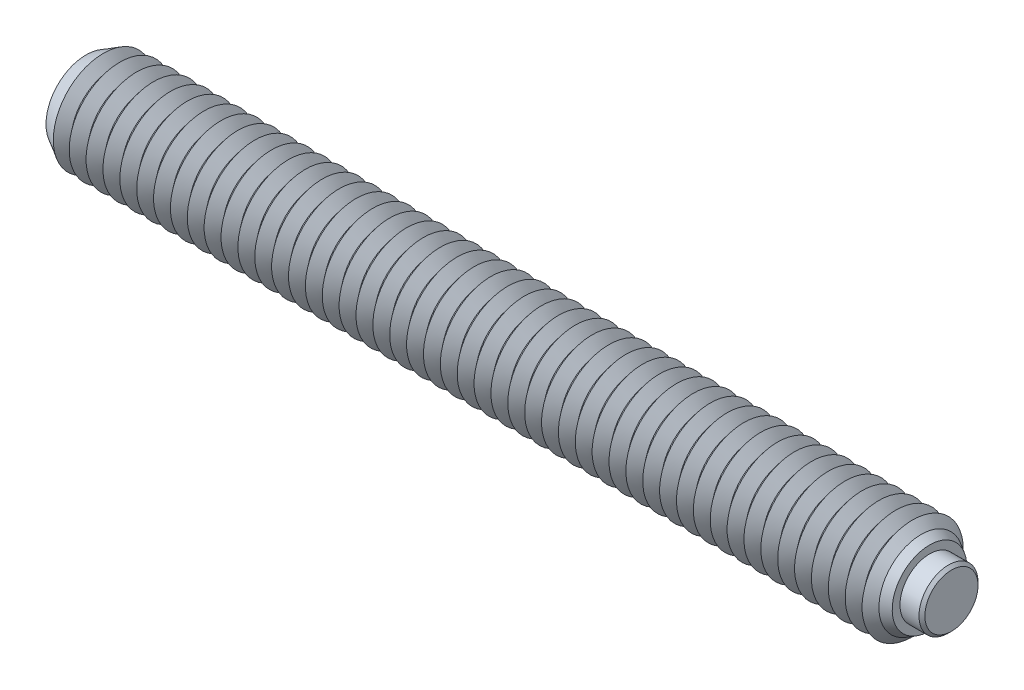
ISO-10303-21;
HEADER;
FILE_DESCRIPTION(('STEP AP214'),'2;1');
FILE_NAME('part.step','',(''),(''),'','','');
FILE_SCHEMA(('AUTOMOTIVE_DESIGN { 1 0 10303 214 1 1 1 1 }'));
ENDSEC;
DATA;
#1=APPLICATION_CONTEXT('core data for automotive mechanical design processes');
#2=APPLICATION_PROTOCOL_DEFINITION('international standard','automotive_design',2000,#1);
#3=PRODUCT_CONTEXT('',#1,'mechanical');
#4=PRODUCT('Part','Part','',(#3));
#5=PRODUCT_RELATED_PRODUCT_CATEGORY('part','',(#4));
#6=PRODUCT_DEFINITION_FORMATION('','',#4);
#7=PRODUCT_DEFINITION_CONTEXT('part definition',#1,'design');
#8=PRODUCT_DEFINITION('design','',#6,#7);
#9=PRODUCT_DEFINITION_SHAPE('','',#8);
#10=(LENGTH_UNIT() NAMED_UNIT(*) SI_UNIT(.MILLI.,.METRE.));
#11=(NAMED_UNIT(*) PLANE_ANGLE_UNIT() SI_UNIT($,.RADIAN.));
#12=(NAMED_UNIT(*) SI_UNIT($,.STERADIAN.) SOLID_ANGLE_UNIT());
#13=UNCERTAINTY_MEASURE_WITH_UNIT(LENGTH_MEASURE(1.E-05),#10,'distance_accuracy_value','');
#14=(GEOMETRIC_REPRESENTATION_CONTEXT(3) GLOBAL_UNCERTAINTY_ASSIGNED_CONTEXT((#13)) GLOBAL_UNIT_ASSIGNED_CONTEXT((#10,
#11,#12)) REPRESENTATION_CONTEXT('',''));
#15=CARTESIAN_POINT('',(0.,0.,0.));
#16=DIRECTION('',(0.,0.,1.));
#17=DIRECTION('',(1.,0.,0.));
#18=AXIS2_PLACEMENT_3D('',#15,#16,#17);
#19=CARTESIAN_POINT('',(1.8,0.,0.));
#20=DIRECTION('',(-1.,0.,0.));
#21=DIRECTION('',(0.,0.,1.));
#22=AXIS2_PLACEMENT_3D('',#19,#20,#21);
#23=CYLINDRICAL_SURFACE('',#22,1.75);
#24=CARTESIAN_POINT('',(1.625,0.,0.));
#25=DIRECTION('',(1.,0.,0.));
#26=DIRECTION('',(0.,0.,-1.));
#27=AXIS2_PLACEMENT_3D('',#24,#25,#26);
#28=CIRCLE('',#27,1.75);
#29=CARTESIAN_POINT('',(1.625,0.,-1.75));
#30=VERTEX_POINT('',#29);
#31=EDGE_CURVE('P0_E10',#30,#30,#28,.F.);
#32=ORIENTED_EDGE('',*,*,#31,.T.);
#33=EDGE_LOOP('',(#32));
#34=FACE_BOUND('',#33,.T.);
#35=CARTESIAN_POINT('',(-0.8,0.,0.));
#36=DIRECTION('',(1.,0.,0.));
#37=DIRECTION('',(0.,0.,-1.));
#38=AXIS2_PLACEMENT_3D('',#35,#36,#37);
#39=CIRCLE('',#38,1.75);
#40=CARTESIAN_POINT('',(-0.8,0.,-1.75));
#41=VERTEX_POINT('',#40);
#42=EDGE_CURVE('P0_E25',#41,#41,#39,.T.);
#43=ORIENTED_EDGE('',*,*,#42,.T.);
#44=EDGE_LOOP('',(#43));
#45=FACE_BOUND('',#44,.T.);
#46=ADVANCED_FACE('P0_F14',(#34,#45),#23,.T.);
#47=CARTESIAN_POINT('',(1.8,0.,0.));
#48=DIRECTION('',(1.,0.,0.));
#49=DIRECTION('',(0.,0.,-1.));
#50=AXIS2_PLACEMENT_3D('',#47,#48,#49);
#51=PLANE('',#50);
#52=CARTESIAN_POINT('',(1.8,0.,0.));
#53=DIRECTION('',(1.,0.,0.));
#54=DIRECTION('',(0.,0.,-1.));
#55=AXIS2_PLACEMENT_3D('',#52,#53,#54);
#56=CIRCLE('',#55,1.575);
#57=CARTESIAN_POINT('',(1.8,0.,-1.575));
#58=VERTEX_POINT('',#57);
#59=EDGE_CURVE('P0_E21',#58,#58,#56,.T.);
#60=ORIENTED_EDGE('',*,*,#59,.T.);
#61=EDGE_LOOP('',(#60));
#62=FACE_BOUND('',#61,.T.);
#63=ADVANCED_FACE('P0_F35',(#62),#51,.T.);
#64=CARTESIAN_POINT('',(-0.8,0.,0.));
#65=DIRECTION('',(1.,0.,0.));
#66=DIRECTION('',(0.,0.,-1.));
#67=AXIS2_PLACEMENT_3D('',#64,#65,#66);
#68=PLANE('',#67);
#69=ORIENTED_EDGE('',*,*,#42,.F.);
#70=EDGE_LOOP('',(#69));
#71=FACE_BOUND('',#70,.T.);
#72=ADVANCED_FACE('P0_F33',(#71),#68,.F.);
#73=CARTESIAN_POINT('',(1.8,0.,0.));
#74=DIRECTION('',(-1.,0.,0.));
#75=DIRECTION('',(0.,0.,1.));
#76=AXIS2_PLACEMENT_3D('',#73,#74,#75);
#77=CONICAL_SURFACE('',#76,1.575,0.785398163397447);
#78=ORIENTED_EDGE('',*,*,#31,.F.);
#79=EDGE_LOOP('',(#78));
#80=FACE_BOUND('',#79,.T.);
#81=ORIENTED_EDGE('',*,*,#59,.F.);
#82=EDGE_LOOP('',(#81));
#83=FACE_BOUND('',#82,.T.);
#84=ADVANCED_FACE('P0_F16',(#80,#83),#77,.T.);
#85=CLOSED_SHELL('',(#46,#63,#72,#84));
#86=MANIFOLD_SOLID_BREP('P0_B1',#85);
#87=CARTESIAN_POINT('',(-48.5,0.,0.));
#88=DIRECTION('',(-1.,0.,0.));
#89=DIRECTION('',(0.,0.,1.));
#90=AXIS2_PLACEMENT_3D('',#87,#88,#89);
#91=CONICAL_SURFACE('',#90,3.,0.895664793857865);
#92=CARTESIAN_POINT('',(-48.,0.,0.));
#93=DIRECTION('',(1.,0.,0.));
#94=DIRECTION('',(0.,0.,-1.));
#95=AXIS2_PLACEMENT_3D('',#92,#93,#94);
#96=CIRCLE('',#95,2.37550020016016);
#97=CARTESIAN_POINT('',(-48.,0.,-2.37550020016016));
#98=VERTEX_POINT('',#97);
#99=EDGE_CURVE('P1_E1737',#98,#98,#96,.T.);
#100=ORIENTED_EDGE('',*,*,#99,.F.);
#101=EDGE_LOOP('',(#100));
#102=FACE_BOUND('',#101,.T.);
#103=CARTESIAN_POINT('',(-48.4741837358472,0.,0.));
#104=DIRECTION('',(1.,0.,0.));
#105=DIRECTION('',(0.,0.,-1.));
#106=AXIS2_PLACEMENT_3D('',#103,#104,#105);
#107=CIRCLE('',#106,2.9677554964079);
#108=CARTESIAN_POINT('',(-48.4741837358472,0.,-2.9677554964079));
#109=VERTEX_POINT('',#108);
#110=EDGE_CURVE('P1_E1740',#109,#109,#107,.F.);
#111=ORIENTED_EDGE('',*,*,#110,.F.);
#112=EDGE_LOOP('',(#111));
#113=FACE_BOUND('',#112,.T.);
#114=ADVANCED_FACE('P1_F15',(#102,#113),#91,.T.);
#115=CARTESIAN_POINT('',(-1.,0.,0.));
#116=DIRECTION('',(1.,0.,0.));
#117=DIRECTION('',(0.,0.,-1.));
#118=AXIS2_PLACEMENT_3D('',#115,#116,#117);
#119=CONICAL_SURFACE('',#118,2.37550020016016,0.895664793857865);
#120=CARTESIAN_POINT('',(-0.5,0.,0.));
#121=DIRECTION('',(1.,0.,0.));
#122=DIRECTION('',(0.,0.,-1.));
#123=AXIS2_PLACEMENT_3D('',#120,#121,#122);
#124=CIRCLE('',#123,3.);
#125=CARTESIAN_POINT('',(-0.5,0.,-3.));
#126=VERTEX_POINT('',#125);
#127=EDGE_CURVE('P1_E1451',#126,#126,#124,.T.);
#128=ORIENTED_EDGE('',*,*,#127,.F.);
#129=EDGE_LOOP('',(#128));
#130=FACE_BOUND('',#129,.T.);
#131=CARTESIAN_POINT('',(-1.,0.,0.));
#132=DIRECTION('',(1.,0.,0.));
#133=DIRECTION('',(0.,0.,-1.));
#134=AXIS2_PLACEMENT_3D('',#131,#132,#133);
#135=CIRCLE('',#134,2.37550020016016);
#136=CARTESIAN_POINT('',(-1.,0.,-2.37550020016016));
#137=VERTEX_POINT('',#136);
#138=EDGE_CURVE('P1_E1452',#137,#137,#135,.T.);
#139=ORIENTED_EDGE('',*,*,#138,.T.);
#140=EDGE_LOOP('',(#139));
#141=FACE_BOUND('',#140,.T.);
#142=ADVANCED_FACE('P1_F222',(#130,#141),#119,.T.);
#143=CARTESIAN_POINT('',(-1.5,0.,0.));
#144=DIRECTION('',(-1.,0.,0.));
#145=DIRECTION('',(0.,0.,1.));
#146=AXIS2_PLACEMENT_3D('',#143,#144,#145);
#147=CONICAL_SURFACE('',#146,3.,0.895664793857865);
#148=ORIENTED_EDGE('',*,*,#138,.F.);
#149=EDGE_LOOP('',(#148));
#150=FACE_BOUND('',#149,.T.);
#151=CARTESIAN_POINT('',(-1.5,0.,0.));
#152=DIRECTION('',(1.,0.,0.));
#153=DIRECTION('',(0.,0.,-1.));
#154=AXIS2_PLACEMENT_3D('',#151,#152,#153);
#155=CIRCLE('',#154,3.);
#156=CARTESIAN_POINT('',(-1.5,0.,-3.));
#157=VERTEX_POINT('',#156);
#158=EDGE_CURVE('P1_E1456',#157,#157,#155,.T.);
#159=ORIENTED_EDGE('',*,*,#158,.T.);
#160=EDGE_LOOP('',(#159));
#161=FACE_BOUND('',#160,.T.);
#162=ADVANCED_FACE('P1_F227',(#150,#161),#147,.T.);
#163=CARTESIAN_POINT('',(-0.8,0.,0.));
#164=DIRECTION('',(1.,0.,0.));
#165=DIRECTION('',(0.,1.,0.));
#166=AXIS2_PLACEMENT_3D('',#163,#164,#165);
#167=PLANE('',#166);
#168=CARTESIAN_POINT('',(-0.8,0.,0.));
#169=DIRECTION('',(1.,0.,0.));
#170=DIRECTION('',(0.,1.,0.));
#171=AXIS2_PLACEMENT_3D('',#168,#169,#170);
#172=CIRCLE('',#171,1.75);
#173=CARTESIAN_POINT('',(-0.8,1.75,0.));
#174=VERTEX_POINT('',#173);
#175=EDGE_CURVE('P1_E678',#174,#174,#172,.T.);
#176=ORIENTED_EDGE('',*,*,#175,.T.);
#177=EDGE_LOOP('',(#176));
#178=FACE_BOUND('',#177,.T.);
#179=ADVANCED_FACE('P1_F605',(#178),#167,.T.);
#180=CARTESIAN_POINT('',(-0.8,0.,0.));
#181=DIRECTION('',(1.,0.,0.));
#182=DIRECTION('',(0.,1.,0.));
#183=AXIS2_PLACEMENT_3D('',#180,#181,#182);
#184=CYLINDRICAL_SURFACE('',#183,1.75);
#185=ORIENTED_EDGE('',*,*,#175,.F.);
#186=EDGE_LOOP('',(#185));
#187=FACE_BOUND('',#186,.T.);
#188=CARTESIAN_POINT('',(0.5,0.,0.));
#189=DIRECTION('',(1.,0.,0.));
#190=DIRECTION('',(0.,1.,0.));
#191=AXIS2_PLACEMENT_3D('',#188,#189,#190);
#192=CIRCLE('',#191,1.75);
#193=CARTESIAN_POINT('',(0.5,1.75,0.));
#194=VERTEX_POINT('',#193);
#195=EDGE_CURVE('P1_E681',#194,#194,#192,.T.);
#196=ORIENTED_EDGE('',*,*,#195,.T.);
#197=EDGE_LOOP('',(#196));
#198=FACE_BOUND('',#197,.T.);
#199=ADVANCED_FACE('P1_F209',(#187,#198),#184,.F.);
#200=CARTESIAN_POINT('',(0.5,2.21132486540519,0.));
#201=DIRECTION('',(1.,0.,0.));
#202=DIRECTION('',(0.,1.,0.));
#203=AXIS2_PLACEMENT_3D('',#200,#201,#202);
#204=PLANE('',#203);
#205=ORIENTED_EDGE('',*,*,#195,.F.);
#206=EDGE_LOOP('',(#205));
#207=FACE_BOUND('',#206,.T.);
#208=CARTESIAN_POINT('',(0.5,0.,0.));
#209=DIRECTION('',(1.,0.,0.));
#210=DIRECTION('',(0.,1.,0.));
#211=AXIS2_PLACEMENT_3D('',#208,#209,#210);
#212=CIRCLE('',#211,2.21132486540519);
#213=CARTESIAN_POINT('',(0.5,2.21132486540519,0.));
#214=VERTEX_POINT('',#213);
#215=EDGE_CURVE('P1_E121',#214,#214,#212,.T.);
#216=ORIENTED_EDGE('',*,*,#215,.T.);
#217=EDGE_LOOP('',(#216));
#218=FACE_BOUND('',#217,.T.);
#219=ADVANCED_FACE('P1_F206',(#207,#218),#204,.T.);
#220=CARTESIAN_POINT('',(0.5,0.,0.));
#221=DIRECTION('',(-1.,0.,0.));
#222=DIRECTION('',(0.,-1.,0.));
#223=AXIS2_PLACEMENT_3D('',#220,#221,#222);
#224=CONICAL_SURFACE('',#223,2.21132486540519,0.523598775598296);
#225=CARTESIAN_POINT('',(0.,0.,0.));
#226=DIRECTION('',(1.,0.,0.));
#227=DIRECTION('',(0.,0.,-1.));
#228=AXIS2_PLACEMENT_3D('',#225,#226,#227);
#229=CIRCLE('',#228,2.5);
#230=CARTESIAN_POINT('',(0.,0.,-2.5));
#231=VERTEX_POINT('',#230);
#232=EDGE_CURVE('P1_E669',#231,#231,#229,.T.);
#233=ORIENTED_EDGE('',*,*,#232,.T.);
#234=EDGE_LOOP('',(#233));
#235=FACE_BOUND('',#234,.T.);
#236=ORIENTED_EDGE('',*,*,#215,.F.);
#237=EDGE_LOOP('',(#236));
#238=FACE_BOUND('',#237,.T.);
#239=ADVANCED_FACE('P1_F203',(#235,#238),#224,.T.);
#240=CARTESIAN_POINT('',(0.,0.,0.));
#241=DIRECTION('',(-1.,0.,0.));
#242=DIRECTION('',(0.,0.,1.));
#243=AXIS2_PLACEMENT_3D('',#240,#241,#242);
#244=CONICAL_SURFACE('',#243,2.5,0.785398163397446);
#245=ORIENTED_EDGE('',*,*,#127,.T.);
#246=EDGE_LOOP('',(#245));
#247=FACE_BOUND('',#246,.T.);
#248=ORIENTED_EDGE('',*,*,#232,.F.);
#249=EDGE_LOOP('',(#248));
#250=FACE_BOUND('',#249,.T.);
#251=ADVANCED_FACE('P1_F17',(#247,#250),#244,.T.);
#252=CARTESIAN_POINT('',(-2.,0.,0.));
#253=DIRECTION('',(1.,0.,0.));
#254=DIRECTION('',(0.,0.,-1.));
#255=AXIS2_PLACEMENT_3D('',#252,#253,#254);
#256=CONICAL_SURFACE('',#255,2.37550020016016,0.895664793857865);
#257=ORIENTED_EDGE('',*,*,#158,.F.);
#258=EDGE_LOOP('',(#257));
#259=FACE_BOUND('',#258,.T.);
#260=CARTESIAN_POINT('',(-2.,0.,0.));
#261=DIRECTION('',(1.,0.,0.));
#262=DIRECTION('',(0.,0.,-1.));
#263=AXIS2_PLACEMENT_3D('',#260,#261,#262);
#264=CIRCLE('',#263,2.37550020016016);
#265=CARTESIAN_POINT('',(-2.,0.,-2.37550020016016));
#266=VERTEX_POINT('',#265);
#267=EDGE_CURVE('P1_E1461',#266,#266,#264,.T.);
#268=ORIENTED_EDGE('',*,*,#267,.T.);
#269=EDGE_LOOP('',(#268));
#270=FACE_BOUND('',#269,.T.);
#271=ADVANCED_FACE('P1_F599',(#259,#270),#256,.T.);
#272=CARTESIAN_POINT('',(-2.5,0.,0.));
#273=DIRECTION('',(-1.,0.,0.));
#274=DIRECTION('',(0.,0.,1.));
#275=AXIS2_PLACEMENT_3D('',#272,#273,#274);
#276=CONICAL_SURFACE('',#275,3.,0.895664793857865);
#277=ORIENTED_EDGE('',*,*,#267,.F.);
#278=EDGE_LOOP('',(#277));
#279=FACE_BOUND('',#278,.T.);
#280=CARTESIAN_POINT('',(-2.5,0.,0.));
#281=DIRECTION('',(1.,0.,0.));
#282=DIRECTION('',(0.,0.,-1.));
#283=AXIS2_PLACEMENT_3D('',#280,#281,#282);
#284=CIRCLE('',#283,3.);
#285=CARTESIAN_POINT('',(-2.5,0.,-3.));
#286=VERTEX_POINT('',#285);
#287=EDGE_CURVE('P1_E1464',#286,#286,#284,.T.);
#288=ORIENTED_EDGE('',*,*,#287,.T.);
#289=EDGE_LOOP('',(#288));
#290=FACE_BOUND('',#289,.T.);
#291=ADVANCED_FACE('P1_F595',(#279,#290),#276,.T.);
#292=CARTESIAN_POINT('',(-3.,0.,0.));
#293=DIRECTION('',(1.,0.,0.));
#294=DIRECTION('',(0.,0.,-1.));
#295=AXIS2_PLACEMENT_3D('',#292,#293,#294);
#296=CONICAL_SURFACE('',#295,2.37550020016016,0.895664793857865);
#297=ORIENTED_EDGE('',*,*,#287,.F.);
#298=EDGE_LOOP('',(#297));
#299=FACE_BOUND('',#298,.T.);
#300=CARTESIAN_POINT('',(-3.,0.,0.));
#301=DIRECTION('',(1.,0.,0.));
#302=DIRECTION('',(0.,0.,-1.));
#303=AXIS2_PLACEMENT_3D('',#300,#301,#302);
#304=CIRCLE('',#303,2.37550020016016);
#305=CARTESIAN_POINT('',(-3.,0.,-2.37550020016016));
#306=VERTEX_POINT('',#305);
#307=EDGE_CURVE('P1_E1467',#306,#306,#304,.T.);
#308=ORIENTED_EDGE('',*,*,#307,.T.);
#309=EDGE_LOOP('',(#308));
#310=FACE_BOUND('',#309,.T.);
#311=ADVANCED_FACE('P1_F591',(#299,#310),#296,.T.);
#312=CARTESIAN_POINT('',(-3.5,0.,0.));
#313=DIRECTION('',(-1.,0.,0.));
#314=DIRECTION('',(0.,0.,1.));
#315=AXIS2_PLACEMENT_3D('',#312,#313,#314);
#316=CONICAL_SURFACE('',#315,3.,0.895664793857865);
#317=ORIENTED_EDGE('',*,*,#307,.F.);
#318=EDGE_LOOP('',(#317));
#319=FACE_BOUND('',#318,.T.);
#320=CARTESIAN_POINT('',(-3.5,0.,0.));
#321=DIRECTION('',(1.,0.,0.));
#322=DIRECTION('',(0.,0.,-1.));
#323=AXIS2_PLACEMENT_3D('',#320,#321,#322);
#324=CIRCLE('',#323,3.);
#325=CARTESIAN_POINT('',(-3.5,0.,-3.));
#326=VERTEX_POINT('',#325);
#327=EDGE_CURVE('P1_E1470',#326,#326,#324,.T.);
#328=ORIENTED_EDGE('',*,*,#327,.T.);
#329=EDGE_LOOP('',(#328));
#330=FACE_BOUND('',#329,.T.);
#331=ADVANCED_FACE('P1_F587',(#319,#330),#316,.T.);
#332=CARTESIAN_POINT('',(-4.,0.,0.));
#333=DIRECTION('',(1.,0.,0.));
#334=DIRECTION('',(0.,0.,-1.));
#335=AXIS2_PLACEMENT_3D('',#332,#333,#334);
#336=CONICAL_SURFACE('',#335,2.37550020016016,0.895664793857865);
#337=ORIENTED_EDGE('',*,*,#327,.F.);
#338=EDGE_LOOP('',(#337));
#339=FACE_BOUND('',#338,.T.);
#340=CARTESIAN_POINT('',(-4.,0.,0.));
#341=DIRECTION('',(1.,0.,0.));
#342=DIRECTION('',(0.,0.,-1.));
#343=AXIS2_PLACEMENT_3D('',#340,#341,#342);
#344=CIRCLE('',#343,2.37550020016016);
#345=CARTESIAN_POINT('',(-4.,0.,-2.37550020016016));
#346=VERTEX_POINT('',#345);
#347=EDGE_CURVE('P1_E1473',#346,#346,#344,.T.);
#348=ORIENTED_EDGE('',*,*,#347,.T.);
#349=EDGE_LOOP('',(#348));
#350=FACE_BOUND('',#349,.T.);
#351=ADVANCED_FACE('P1_F583',(#339,#350),#336,.T.);
#352=CARTESIAN_POINT('',(-4.5,0.,0.));
#353=DIRECTION('',(-1.,0.,0.));
#354=DIRECTION('',(0.,0.,1.));
#355=AXIS2_PLACEMENT_3D('',#352,#353,#354);
#356=CONICAL_SURFACE('',#355,3.,0.895664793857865);
#357=ORIENTED_EDGE('',*,*,#347,.F.);
#358=EDGE_LOOP('',(#357));
#359=FACE_BOUND('',#358,.T.);
#360=CARTESIAN_POINT('',(-4.5,0.,0.));
#361=DIRECTION('',(1.,0.,0.));
#362=DIRECTION('',(0.,0.,-1.));
#363=AXIS2_PLACEMENT_3D('',#360,#361,#362);
#364=CIRCLE('',#363,3.);
#365=CARTESIAN_POINT('',(-4.5,0.,-3.));
#366=VERTEX_POINT('',#365);
#367=EDGE_CURVE('P1_E1476',#366,#366,#364,.T.);
#368=ORIENTED_EDGE('',*,*,#367,.T.);
#369=EDGE_LOOP('',(#368));
#370=FACE_BOUND('',#369,.T.);
#371=ADVANCED_FACE('P1_F579',(#359,#370),#356,.T.);
#372=CARTESIAN_POINT('',(-5.,0.,0.));
#373=DIRECTION('',(1.,0.,0.));
#374=DIRECTION('',(0.,0.,-1.));
#375=AXIS2_PLACEMENT_3D('',#372,#373,#374);
#376=CONICAL_SURFACE('',#375,2.37550020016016,0.895664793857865);
#377=ORIENTED_EDGE('',*,*,#367,.F.);
#378=EDGE_LOOP('',(#377));
#379=FACE_BOUND('',#378,.T.);
#380=CARTESIAN_POINT('',(-5.,0.,0.));
#381=DIRECTION('',(1.,0.,0.));
#382=DIRECTION('',(0.,0.,-1.));
#383=AXIS2_PLACEMENT_3D('',#380,#381,#382);
#384=CIRCLE('',#383,2.37550020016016);
#385=CARTESIAN_POINT('',(-5.,0.,-2.37550020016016));
#386=VERTEX_POINT('',#385);
#387=EDGE_CURVE('P1_E1479',#386,#386,#384,.T.);
#388=ORIENTED_EDGE('',*,*,#387,.T.);
#389=EDGE_LOOP('',(#388));
#390=FACE_BOUND('',#389,.T.);
#391=ADVANCED_FACE('P1_F575',(#379,#390),#376,.T.);
#392=CARTESIAN_POINT('',(-5.5,0.,0.));
#393=DIRECTION('',(-1.,0.,0.));
#394=DIRECTION('',(0.,0.,1.));
#395=AXIS2_PLACEMENT_3D('',#392,#393,#394);
#396=CONICAL_SURFACE('',#395,3.,0.895664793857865);
#397=ORIENTED_EDGE('',*,*,#387,.F.);
#398=EDGE_LOOP('',(#397));
#399=FACE_BOUND('',#398,.T.);
#400=CARTESIAN_POINT('',(-5.5,0.,0.));
#401=DIRECTION('',(1.,0.,0.));
#402=DIRECTION('',(0.,0.,-1.));
#403=AXIS2_PLACEMENT_3D('',#400,#401,#402);
#404=CIRCLE('',#403,3.);
#405=CARTESIAN_POINT('',(-5.5,0.,-3.));
#406=VERTEX_POINT('',#405);
#407=EDGE_CURVE('P1_E1482',#406,#406,#404,.T.);
#408=ORIENTED_EDGE('',*,*,#407,.T.);
#409=EDGE_LOOP('',(#408));
#410=FACE_BOUND('',#409,.T.);
#411=ADVANCED_FACE('P1_F571',(#399,#410),#396,.T.);
#412=CARTESIAN_POINT('',(-6.,0.,0.));
#413=DIRECTION('',(1.,0.,0.));
#414=DIRECTION('',(0.,0.,-1.));
#415=AXIS2_PLACEMENT_3D('',#412,#413,#414);
#416=CONICAL_SURFACE('',#415,2.37550020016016,0.895664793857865);
#417=ORIENTED_EDGE('',*,*,#407,.F.);
#418=EDGE_LOOP('',(#417));
#419=FACE_BOUND('',#418,.T.);
#420=CARTESIAN_POINT('',(-6.,0.,0.));
#421=DIRECTION('',(1.,0.,0.));
#422=DIRECTION('',(0.,0.,-1.));
#423=AXIS2_PLACEMENT_3D('',#420,#421,#422);
#424=CIRCLE('',#423,2.37550020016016);
#425=CARTESIAN_POINT('',(-6.,0.,-2.37550020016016));
#426=VERTEX_POINT('',#425);
#427=EDGE_CURVE('P1_E1485',#426,#426,#424,.T.);
#428=ORIENTED_EDGE('',*,*,#427,.T.);
#429=EDGE_LOOP('',(#428));
#430=FACE_BOUND('',#429,.T.);
#431=ADVANCED_FACE('P1_F567',(#419,#430),#416,.T.);
#432=CARTESIAN_POINT('',(-6.5,0.,0.));
#433=DIRECTION('',(-1.,0.,0.));
#434=DIRECTION('',(0.,0.,1.));
#435=AXIS2_PLACEMENT_3D('',#432,#433,#434);
#436=CONICAL_SURFACE('',#435,3.,0.895664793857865);
#437=ORIENTED_EDGE('',*,*,#427,.F.);
#438=EDGE_LOOP('',(#437));
#439=FACE_BOUND('',#438,.T.);
#440=CARTESIAN_POINT('',(-6.5,0.,0.));
#441=DIRECTION('',(1.,0.,0.));
#442=DIRECTION('',(0.,0.,-1.));
#443=AXIS2_PLACEMENT_3D('',#440,#441,#442);
#444=CIRCLE('',#443,3.);
#445=CARTESIAN_POINT('',(-6.5,0.,-3.));
#446=VERTEX_POINT('',#445);
#447=EDGE_CURVE('P1_E1488',#446,#446,#444,.T.);
#448=ORIENTED_EDGE('',*,*,#447,.T.);
#449=EDGE_LOOP('',(#448));
#450=FACE_BOUND('',#449,.T.);
#451=ADVANCED_FACE('P1_F563',(#439,#450),#436,.T.);
#452=CARTESIAN_POINT('',(-7.,0.,0.));
#453=DIRECTION('',(1.,0.,0.));
#454=DIRECTION('',(0.,0.,-1.));
#455=AXIS2_PLACEMENT_3D('',#452,#453,#454);
#456=CONICAL_SURFACE('',#455,2.37550020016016,0.895664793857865);
#457=ORIENTED_EDGE('',*,*,#447,.F.);
#458=EDGE_LOOP('',(#457));
#459=FACE_BOUND('',#458,.T.);
#460=CARTESIAN_POINT('',(-7.,0.,0.));
#461=DIRECTION('',(1.,0.,0.));
#462=DIRECTION('',(0.,0.,-1.));
#463=AXIS2_PLACEMENT_3D('',#460,#461,#462);
#464=CIRCLE('',#463,2.37550020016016);
#465=CARTESIAN_POINT('',(-7.,0.,-2.37550020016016));
#466=VERTEX_POINT('',#465);
#467=EDGE_CURVE('P1_E1491',#466,#466,#464,.T.);
#468=ORIENTED_EDGE('',*,*,#467,.T.);
#469=EDGE_LOOP('',(#468));
#470=FACE_BOUND('',#469,.T.);
#471=ADVANCED_FACE('P1_F559',(#459,#470),#456,.T.);
#472=CARTESIAN_POINT('',(-7.5,0.,0.));
#473=DIRECTION('',(-1.,0.,0.));
#474=DIRECTION('',(0.,0.,1.));
#475=AXIS2_PLACEMENT_3D('',#472,#473,#474);
#476=CONICAL_SURFACE('',#475,3.,0.895664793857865);
#477=ORIENTED_EDGE('',*,*,#467,.F.);
#478=EDGE_LOOP('',(#477));
#479=FACE_BOUND('',#478,.T.);
#480=CARTESIAN_POINT('',(-7.5,0.,0.));
#481=DIRECTION('',(1.,0.,0.));
#482=DIRECTION('',(0.,0.,-1.));
#483=AXIS2_PLACEMENT_3D('',#480,#481,#482);
#484=CIRCLE('',#483,3.);
#485=CARTESIAN_POINT('',(-7.5,0.,-3.));
#486=VERTEX_POINT('',#485);
#487=EDGE_CURVE('P1_E1494',#486,#486,#484,.T.);
#488=ORIENTED_EDGE('',*,*,#487,.T.);
#489=EDGE_LOOP('',(#488));
#490=FACE_BOUND('',#489,.T.);
#491=ADVANCED_FACE('P1_F555',(#479,#490),#476,.T.);
#492=CARTESIAN_POINT('',(-8.,0.,0.));
#493=DIRECTION('',(1.,0.,0.));
#494=DIRECTION('',(0.,0.,-1.));
#495=AXIS2_PLACEMENT_3D('',#492,#493,#494);
#496=CONICAL_SURFACE('',#495,2.37550020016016,0.895664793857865);
#497=ORIENTED_EDGE('',*,*,#487,.F.);
#498=EDGE_LOOP('',(#497));
#499=FACE_BOUND('',#498,.T.);
#500=CARTESIAN_POINT('',(-8.,0.,0.));
#501=DIRECTION('',(1.,0.,0.));
#502=DIRECTION('',(0.,0.,-1.));
#503=AXIS2_PLACEMENT_3D('',#500,#501,#502);
#504=CIRCLE('',#503,2.37550020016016);
#505=CARTESIAN_POINT('',(-8.,0.,-2.37550020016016));
#506=VERTEX_POINT('',#505);
#507=EDGE_CURVE('P1_E1497',#506,#506,#504,.T.);
#508=ORIENTED_EDGE('',*,*,#507,.T.);
#509=EDGE_LOOP('',(#508));
#510=FACE_BOUND('',#509,.T.);
#511=ADVANCED_FACE('P1_F551',(#499,#510),#496,.T.);
#512=CARTESIAN_POINT('',(-8.5,0.,0.));
#513=DIRECTION('',(-1.,0.,0.));
#514=DIRECTION('',(0.,0.,1.));
#515=AXIS2_PLACEMENT_3D('',#512,#513,#514);
#516=CONICAL_SURFACE('',#515,3.,0.895664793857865);
#517=ORIENTED_EDGE('',*,*,#507,.F.);
#518=EDGE_LOOP('',(#517));
#519=FACE_BOUND('',#518,.T.);
#520=CARTESIAN_POINT('',(-8.5,0.,0.));
#521=DIRECTION('',(1.,0.,0.));
#522=DIRECTION('',(0.,0.,-1.));
#523=AXIS2_PLACEMENT_3D('',#520,#521,#522);
#524=CIRCLE('',#523,3.);
#525=CARTESIAN_POINT('',(-8.5,0.,-3.));
#526=VERTEX_POINT('',#525);
#527=EDGE_CURVE('P1_E1500',#526,#526,#524,.T.);
#528=ORIENTED_EDGE('',*,*,#527,.T.);
#529=EDGE_LOOP('',(#528));
#530=FACE_BOUND('',#529,.T.);
#531=ADVANCED_FACE('P1_F547',(#519,#530),#516,.T.);
#532=CARTESIAN_POINT('',(-9.,0.,0.));
#533=DIRECTION('',(1.,0.,0.));
#534=DIRECTION('',(0.,0.,-1.));
#535=AXIS2_PLACEMENT_3D('',#532,#533,#534);
#536=CONICAL_SURFACE('',#535,2.37550020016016,0.895664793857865);
#537=ORIENTED_EDGE('',*,*,#527,.F.);
#538=EDGE_LOOP('',(#537));
#539=FACE_BOUND('',#538,.T.);
#540=CARTESIAN_POINT('',(-9.,0.,0.));
#541=DIRECTION('',(1.,0.,0.));
#542=DIRECTION('',(0.,0.,-1.));
#543=AXIS2_PLACEMENT_3D('',#540,#541,#542);
#544=CIRCLE('',#543,2.37550020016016);
#545=CARTESIAN_POINT('',(-9.,0.,-2.37550020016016));
#546=VERTEX_POINT('',#545);
#547=EDGE_CURVE('P1_E1503',#546,#546,#544,.T.);
#548=ORIENTED_EDGE('',*,*,#547,.T.);
#549=EDGE_LOOP('',(#548));
#550=FACE_BOUND('',#549,.T.);
#551=ADVANCED_FACE('P1_F543',(#539,#550),#536,.T.);
#552=CARTESIAN_POINT('',(-9.5,0.,0.));
#553=DIRECTION('',(-1.,0.,0.));
#554=DIRECTION('',(0.,0.,1.));
#555=AXIS2_PLACEMENT_3D('',#552,#553,#554);
#556=CONICAL_SURFACE('',#555,3.,0.895664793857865);
#557=ORIENTED_EDGE('',*,*,#547,.F.);
#558=EDGE_LOOP('',(#557));
#559=FACE_BOUND('',#558,.T.);
#560=CARTESIAN_POINT('',(-9.5,0.,0.));
#561=DIRECTION('',(1.,0.,0.));
#562=DIRECTION('',(0.,0.,-1.));
#563=AXIS2_PLACEMENT_3D('',#560,#561,#562);
#564=CIRCLE('',#563,3.);
#565=CARTESIAN_POINT('',(-9.5,0.,-3.));
#566=VERTEX_POINT('',#565);
#567=EDGE_CURVE('P1_E1506',#566,#566,#564,.T.);
#568=ORIENTED_EDGE('',*,*,#567,.T.);
#569=EDGE_LOOP('',(#568));
#570=FACE_BOUND('',#569,.T.);
#571=ADVANCED_FACE('P1_F539',(#559,#570),#556,.T.);
#572=CARTESIAN_POINT('',(-10.,0.,0.));
#573=DIRECTION('',(1.,0.,0.));
#574=DIRECTION('',(0.,0.,-1.));
#575=AXIS2_PLACEMENT_3D('',#572,#573,#574);
#576=CONICAL_SURFACE('',#575,2.37550020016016,0.895664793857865);
#577=ORIENTED_EDGE('',*,*,#567,.F.);
#578=EDGE_LOOP('',(#577));
#579=FACE_BOUND('',#578,.T.);
#580=CARTESIAN_POINT('',(-10.,0.,0.));
#581=DIRECTION('',(1.,0.,0.));
#582=DIRECTION('',(0.,0.,-1.));
#583=AXIS2_PLACEMENT_3D('',#580,#581,#582);
#584=CIRCLE('',#583,2.37550020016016);
#585=CARTESIAN_POINT('',(-10.,0.,-2.37550020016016));
#586=VERTEX_POINT('',#585);
#587=EDGE_CURVE('P1_E1509',#586,#586,#584,.T.);
#588=ORIENTED_EDGE('',*,*,#587,.T.);
#589=EDGE_LOOP('',(#588));
#590=FACE_BOUND('',#589,.T.);
#591=ADVANCED_FACE('P1_F535',(#579,#590),#576,.T.);
#592=CARTESIAN_POINT('',(-10.5,0.,0.));
#593=DIRECTION('',(-1.,0.,0.));
#594=DIRECTION('',(0.,0.,1.));
#595=AXIS2_PLACEMENT_3D('',#592,#593,#594);
#596=CONICAL_SURFACE('',#595,3.,0.895664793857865);
#597=ORIENTED_EDGE('',*,*,#587,.F.);
#598=EDGE_LOOP('',(#597));
#599=FACE_BOUND('',#598,.T.);
#600=CARTESIAN_POINT('',(-10.5,0.,0.));
#601=DIRECTION('',(1.,0.,0.));
#602=DIRECTION('',(0.,0.,-1.));
#603=AXIS2_PLACEMENT_3D('',#600,#601,#602);
#604=CIRCLE('',#603,3.);
#605=CARTESIAN_POINT('',(-10.5,0.,-3.));
#606=VERTEX_POINT('',#605);
#607=EDGE_CURVE('P1_E1512',#606,#606,#604,.T.);
#608=ORIENTED_EDGE('',*,*,#607,.T.);
#609=EDGE_LOOP('',(#608));
#610=FACE_BOUND('',#609,.T.);
#611=ADVANCED_FACE('P1_F531',(#599,#610),#596,.T.);
#612=CARTESIAN_POINT('',(-11.,0.,0.));
#613=DIRECTION('',(1.,0.,0.));
#614=DIRECTION('',(0.,0.,-1.));
#615=AXIS2_PLACEMENT_3D('',#612,#613,#614);
#616=CONICAL_SURFACE('',#615,2.37550020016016,0.895664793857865);
#617=ORIENTED_EDGE('',*,*,#607,.F.);
#618=EDGE_LOOP('',(#617));
#619=FACE_BOUND('',#618,.T.);
#620=CARTESIAN_POINT('',(-11.,0.,0.));
#621=DIRECTION('',(1.,0.,0.));
#622=DIRECTION('',(0.,0.,-1.));
#623=AXIS2_PLACEMENT_3D('',#620,#621,#622);
#624=CIRCLE('',#623,2.37550020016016);
#625=CARTESIAN_POINT('',(-11.,0.,-2.37550020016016));
#626=VERTEX_POINT('',#625);
#627=EDGE_CURVE('P1_E1515',#626,#626,#624,.T.);
#628=ORIENTED_EDGE('',*,*,#627,.T.);
#629=EDGE_LOOP('',(#628));
#630=FACE_BOUND('',#629,.T.);
#631=ADVANCED_FACE('P1_F527',(#619,#630),#616,.T.);
#632=CARTESIAN_POINT('',(-11.5,0.,0.));
#633=DIRECTION('',(-1.,0.,0.));
#634=DIRECTION('',(0.,0.,1.));
#635=AXIS2_PLACEMENT_3D('',#632,#633,#634);
#636=CONICAL_SURFACE('',#635,3.,0.895664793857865);
#637=ORIENTED_EDGE('',*,*,#627,.F.);
#638=EDGE_LOOP('',(#637));
#639=FACE_BOUND('',#638,.T.);
#640=CARTESIAN_POINT('',(-11.5,0.,0.));
#641=DIRECTION('',(1.,0.,0.));
#642=DIRECTION('',(0.,0.,-1.));
#643=AXIS2_PLACEMENT_3D('',#640,#641,#642);
#644=CIRCLE('',#643,3.);
#645=CARTESIAN_POINT('',(-11.5,0.,-3.));
#646=VERTEX_POINT('',#645);
#647=EDGE_CURVE('P1_E1518',#646,#646,#644,.T.);
#648=ORIENTED_EDGE('',*,*,#647,.T.);
#649=EDGE_LOOP('',(#648));
#650=FACE_BOUND('',#649,.T.);
#651=ADVANCED_FACE('P1_F523',(#639,#650),#636,.T.);
#652=CARTESIAN_POINT('',(-12.,0.,0.));
#653=DIRECTION('',(1.,0.,0.));
#654=DIRECTION('',(0.,0.,-1.));
#655=AXIS2_PLACEMENT_3D('',#652,#653,#654);
#656=CONICAL_SURFACE('',#655,2.37550020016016,0.895664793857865);
#657=ORIENTED_EDGE('',*,*,#647,.F.);
#658=EDGE_LOOP('',(#657));
#659=FACE_BOUND('',#658,.T.);
#660=CARTESIAN_POINT('',(-12.,0.,0.));
#661=DIRECTION('',(1.,0.,0.));
#662=DIRECTION('',(0.,0.,-1.));
#663=AXIS2_PLACEMENT_3D('',#660,#661,#662);
#664=CIRCLE('',#663,2.37550020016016);
#665=CARTESIAN_POINT('',(-12.,0.,-2.37550020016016));
#666=VERTEX_POINT('',#665);
#667=EDGE_CURVE('P1_E1521',#666,#666,#664,.T.);
#668=ORIENTED_EDGE('',*,*,#667,.T.);
#669=EDGE_LOOP('',(#668));
#670=FACE_BOUND('',#669,.T.);
#671=ADVANCED_FACE('P1_F519',(#659,#670),#656,.T.);
#672=CARTESIAN_POINT('',(-12.5,0.,0.));
#673=DIRECTION('',(-1.,0.,0.));
#674=DIRECTION('',(0.,0.,1.));
#675=AXIS2_PLACEMENT_3D('',#672,#673,#674);
#676=CONICAL_SURFACE('',#675,3.,0.895664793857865);
#677=ORIENTED_EDGE('',*,*,#667,.F.);
#678=EDGE_LOOP('',(#677));
#679=FACE_BOUND('',#678,.T.);
#680=CARTESIAN_POINT('',(-12.5,0.,0.));
#681=DIRECTION('',(1.,0.,0.));
#682=DIRECTION('',(0.,0.,-1.));
#683=AXIS2_PLACEMENT_3D('',#680,#681,#682);
#684=CIRCLE('',#683,3.);
#685=CARTESIAN_POINT('',(-12.5,0.,-3.));
#686=VERTEX_POINT('',#685);
#687=EDGE_CURVE('P1_E1524',#686,#686,#684,.T.);
#688=ORIENTED_EDGE('',*,*,#687,.T.);
#689=EDGE_LOOP('',(#688));
#690=FACE_BOUND('',#689,.T.);
#691=ADVANCED_FACE('P1_F515',(#679,#690),#676,.T.);
#692=CARTESIAN_POINT('',(-13.,0.,0.));
#693=DIRECTION('',(1.,0.,0.));
#694=DIRECTION('',(0.,0.,-1.));
#695=AXIS2_PLACEMENT_3D('',#692,#693,#694);
#696=CONICAL_SURFACE('',#695,2.37550020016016,0.895664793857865);
#697=ORIENTED_EDGE('',*,*,#687,.F.);
#698=EDGE_LOOP('',(#697));
#699=FACE_BOUND('',#698,.T.);
#700=CARTESIAN_POINT('',(-13.,0.,0.));
#701=DIRECTION('',(1.,0.,0.));
#702=DIRECTION('',(0.,0.,-1.));
#703=AXIS2_PLACEMENT_3D('',#700,#701,#702);
#704=CIRCLE('',#703,2.37550020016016);
#705=CARTESIAN_POINT('',(-13.,0.,-2.37550020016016));
#706=VERTEX_POINT('',#705);
#707=EDGE_CURVE('P1_E1527',#706,#706,#704,.T.);
#708=ORIENTED_EDGE('',*,*,#707,.T.);
#709=EDGE_LOOP('',(#708));
#710=FACE_BOUND('',#709,.T.);
#711=ADVANCED_FACE('P1_F511',(#699,#710),#696,.T.);
#712=CARTESIAN_POINT('',(-13.5,0.,0.));
#713=DIRECTION('',(-1.,0.,0.));
#714=DIRECTION('',(0.,0.,1.));
#715=AXIS2_PLACEMENT_3D('',#712,#713,#714);
#716=CONICAL_SURFACE('',#715,3.,0.895664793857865);
#717=ORIENTED_EDGE('',*,*,#707,.F.);
#718=EDGE_LOOP('',(#717));
#719=FACE_BOUND('',#718,.T.);
#720=CARTESIAN_POINT('',(-13.5,0.,0.));
#721=DIRECTION('',(1.,0.,0.));
#722=DIRECTION('',(0.,0.,-1.));
#723=AXIS2_PLACEMENT_3D('',#720,#721,#722);
#724=CIRCLE('',#723,3.);
#725=CARTESIAN_POINT('',(-13.5,0.,-3.));
#726=VERTEX_POINT('',#725);
#727=EDGE_CURVE('P1_E1530',#726,#726,#724,.T.);
#728=ORIENTED_EDGE('',*,*,#727,.T.);
#729=EDGE_LOOP('',(#728));
#730=FACE_BOUND('',#729,.T.);
#731=ADVANCED_FACE('P1_F507',(#719,#730),#716,.T.);
#732=CARTESIAN_POINT('',(-14.,0.,0.));
#733=DIRECTION('',(1.,0.,0.));
#734=DIRECTION('',(0.,0.,-1.));
#735=AXIS2_PLACEMENT_3D('',#732,#733,#734);
#736=CONICAL_SURFACE('',#735,2.37550020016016,0.895664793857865);
#737=ORIENTED_EDGE('',*,*,#727,.F.);
#738=EDGE_LOOP('',(#737));
#739=FACE_BOUND('',#738,.T.);
#740=CARTESIAN_POINT('',(-14.,0.,0.));
#741=DIRECTION('',(1.,0.,0.));
#742=DIRECTION('',(0.,0.,-1.));
#743=AXIS2_PLACEMENT_3D('',#740,#741,#742);
#744=CIRCLE('',#743,2.37550020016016);
#745=CARTESIAN_POINT('',(-14.,0.,-2.37550020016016));
#746=VERTEX_POINT('',#745);
#747=EDGE_CURVE('P1_E1533',#746,#746,#744,.T.);
#748=ORIENTED_EDGE('',*,*,#747,.T.);
#749=EDGE_LOOP('',(#748));
#750=FACE_BOUND('',#749,.T.);
#751=ADVANCED_FACE('P1_F503',(#739,#750),#736,.T.);
#752=CARTESIAN_POINT('',(-14.5,0.,0.));
#753=DIRECTION('',(-1.,0.,0.));
#754=DIRECTION('',(0.,0.,1.));
#755=AXIS2_PLACEMENT_3D('',#752,#753,#754);
#756=CONICAL_SURFACE('',#755,3.,0.895664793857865);
#757=ORIENTED_EDGE('',*,*,#747,.F.);
#758=EDGE_LOOP('',(#757));
#759=FACE_BOUND('',#758,.T.);
#760=CARTESIAN_POINT('',(-14.5,0.,0.));
#761=DIRECTION('',(1.,0.,0.));
#762=DIRECTION('',(0.,0.,-1.));
#763=AXIS2_PLACEMENT_3D('',#760,#761,#762);
#764=CIRCLE('',#763,3.);
#765=CARTESIAN_POINT('',(-14.5,0.,-3.));
#766=VERTEX_POINT('',#765);
#767=EDGE_CURVE('P1_E1536',#766,#766,#764,.T.);
#768=ORIENTED_EDGE('',*,*,#767,.T.);
#769=EDGE_LOOP('',(#768));
#770=FACE_BOUND('',#769,.T.);
#771=ADVANCED_FACE('P1_F499',(#759,#770),#756,.T.);
#772=CARTESIAN_POINT('',(-15.,0.,0.));
#773=DIRECTION('',(1.,0.,0.));
#774=DIRECTION('',(0.,0.,-1.));
#775=AXIS2_PLACEMENT_3D('',#772,#773,#774);
#776=CONICAL_SURFACE('',#775,2.37550020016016,0.895664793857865);
#777=ORIENTED_EDGE('',*,*,#767,.F.);
#778=EDGE_LOOP('',(#777));
#779=FACE_BOUND('',#778,.T.);
#780=CARTESIAN_POINT('',(-15.,0.,0.));
#781=DIRECTION('',(1.,0.,0.));
#782=DIRECTION('',(0.,0.,-1.));
#783=AXIS2_PLACEMENT_3D('',#780,#781,#782);
#784=CIRCLE('',#783,2.37550020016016);
#785=CARTESIAN_POINT('',(-15.,0.,-2.37550020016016));
#786=VERTEX_POINT('',#785);
#787=EDGE_CURVE('P1_E1539',#786,#786,#784,.T.);
#788=ORIENTED_EDGE('',*,*,#787,.T.);
#789=EDGE_LOOP('',(#788));
#790=FACE_BOUND('',#789,.T.);
#791=ADVANCED_FACE('P1_F495',(#779,#790),#776,.T.);
#792=CARTESIAN_POINT('',(-15.5,0.,0.));
#793=DIRECTION('',(-1.,0.,0.));
#794=DIRECTION('',(0.,0.,1.));
#795=AXIS2_PLACEMENT_3D('',#792,#793,#794);
#796=CONICAL_SURFACE('',#795,3.,0.895664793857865);
#797=ORIENTED_EDGE('',*,*,#787,.F.);
#798=EDGE_LOOP('',(#797));
#799=FACE_BOUND('',#798,.T.);
#800=CARTESIAN_POINT('',(-15.5,0.,0.));
#801=DIRECTION('',(1.,0.,0.));
#802=DIRECTION('',(0.,0.,-1.));
#803=AXIS2_PLACEMENT_3D('',#800,#801,#802);
#804=CIRCLE('',#803,3.);
#805=CARTESIAN_POINT('',(-15.5,0.,-3.));
#806=VERTEX_POINT('',#805);
#807=EDGE_CURVE('P1_E1542',#806,#806,#804,.T.);
#808=ORIENTED_EDGE('',*,*,#807,.T.);
#809=EDGE_LOOP('',(#808));
#810=FACE_BOUND('',#809,.T.);
#811=ADVANCED_FACE('P1_F491',(#799,#810),#796,.T.);
#812=CARTESIAN_POINT('',(-16.,0.,0.));
#813=DIRECTION('',(1.,0.,0.));
#814=DIRECTION('',(0.,0.,-1.));
#815=AXIS2_PLACEMENT_3D('',#812,#813,#814);
#816=CONICAL_SURFACE('',#815,2.37550020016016,0.895664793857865);
#817=ORIENTED_EDGE('',*,*,#807,.F.);
#818=EDGE_LOOP('',(#817));
#819=FACE_BOUND('',#818,.T.);
#820=CARTESIAN_POINT('',(-16.,0.,0.));
#821=DIRECTION('',(1.,0.,0.));
#822=DIRECTION('',(0.,0.,-1.));
#823=AXIS2_PLACEMENT_3D('',#820,#821,#822);
#824=CIRCLE('',#823,2.37550020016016);
#825=CARTESIAN_POINT('',(-16.,0.,-2.37550020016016));
#826=VERTEX_POINT('',#825);
#827=EDGE_CURVE('P1_E1545',#826,#826,#824,.T.);
#828=ORIENTED_EDGE('',*,*,#827,.T.);
#829=EDGE_LOOP('',(#828));
#830=FACE_BOUND('',#829,.T.);
#831=ADVANCED_FACE('P1_F487',(#819,#830),#816,.T.);
#832=CARTESIAN_POINT('',(-16.5,0.,0.));
#833=DIRECTION('',(-1.,0.,0.));
#834=DIRECTION('',(0.,0.,1.));
#835=AXIS2_PLACEMENT_3D('',#832,#833,#834);
#836=CONICAL_SURFACE('',#835,3.,0.895664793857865);
#837=ORIENTED_EDGE('',*,*,#827,.F.);
#838=EDGE_LOOP('',(#837));
#839=FACE_BOUND('',#838,.T.);
#840=CARTESIAN_POINT('',(-16.5,0.,0.));
#841=DIRECTION('',(1.,0.,0.));
#842=DIRECTION('',(0.,0.,-1.));
#843=AXIS2_PLACEMENT_3D('',#840,#841,#842);
#844=CIRCLE('',#843,3.);
#845=CARTESIAN_POINT('',(-16.5,0.,-3.));
#846=VERTEX_POINT('',#845);
#847=EDGE_CURVE('P1_E1548',#846,#846,#844,.T.);
#848=ORIENTED_EDGE('',*,*,#847,.T.);
#849=EDGE_LOOP('',(#848));
#850=FACE_BOUND('',#849,.T.);
#851=ADVANCED_FACE('P1_F483',(#839,#850),#836,.T.);
#852=CARTESIAN_POINT('',(-17.,0.,0.));
#853=DIRECTION('',(1.,0.,0.));
#854=DIRECTION('',(0.,0.,-1.));
#855=AXIS2_PLACEMENT_3D('',#852,#853,#854);
#856=CONICAL_SURFACE('',#855,2.37550020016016,0.895664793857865);
#857=ORIENTED_EDGE('',*,*,#847,.F.);
#858=EDGE_LOOP('',(#857));
#859=FACE_BOUND('',#858,.T.);
#860=CARTESIAN_POINT('',(-17.,0.,0.));
#861=DIRECTION('',(1.,0.,0.));
#862=DIRECTION('',(0.,0.,-1.));
#863=AXIS2_PLACEMENT_3D('',#860,#861,#862);
#864=CIRCLE('',#863,2.37550020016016);
#865=CARTESIAN_POINT('',(-17.,0.,-2.37550020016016));
#866=VERTEX_POINT('',#865);
#867=EDGE_CURVE('P1_E1551',#866,#866,#864,.T.);
#868=ORIENTED_EDGE('',*,*,#867,.T.);
#869=EDGE_LOOP('',(#868));
#870=FACE_BOUND('',#869,.T.);
#871=ADVANCED_FACE('P1_F479',(#859,#870),#856,.T.);
#872=CARTESIAN_POINT('',(-17.5,0.,0.));
#873=DIRECTION('',(-1.,0.,0.));
#874=DIRECTION('',(0.,0.,1.));
#875=AXIS2_PLACEMENT_3D('',#872,#873,#874);
#876=CONICAL_SURFACE('',#875,3.,0.895664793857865);
#877=ORIENTED_EDGE('',*,*,#867,.F.);
#878=EDGE_LOOP('',(#877));
#879=FACE_BOUND('',#878,.T.);
#880=CARTESIAN_POINT('',(-17.5,0.,0.));
#881=DIRECTION('',(1.,0.,0.));
#882=DIRECTION('',(0.,0.,-1.));
#883=AXIS2_PLACEMENT_3D('',#880,#881,#882);
#884=CIRCLE('',#883,3.);
#885=CARTESIAN_POINT('',(-17.5,0.,-3.));
#886=VERTEX_POINT('',#885);
#887=EDGE_CURVE('P1_E1554',#886,#886,#884,.T.);
#888=ORIENTED_EDGE('',*,*,#887,.T.);
#889=EDGE_LOOP('',(#888));
#890=FACE_BOUND('',#889,.T.);
#891=ADVANCED_FACE('P1_F475',(#879,#890),#876,.T.);
#892=CARTESIAN_POINT('',(-18.,0.,0.));
#893=DIRECTION('',(1.,0.,0.));
#894=DIRECTION('',(0.,0.,-1.));
#895=AXIS2_PLACEMENT_3D('',#892,#893,#894);
#896=CONICAL_SURFACE('',#895,2.37550020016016,0.895664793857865);
#897=ORIENTED_EDGE('',*,*,#887,.F.);
#898=EDGE_LOOP('',(#897));
#899=FACE_BOUND('',#898,.T.);
#900=CARTESIAN_POINT('',(-18.,0.,0.));
#901=DIRECTION('',(1.,0.,0.));
#902=DIRECTION('',(0.,0.,-1.));
#903=AXIS2_PLACEMENT_3D('',#900,#901,#902);
#904=CIRCLE('',#903,2.37550020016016);
#905=CARTESIAN_POINT('',(-18.,0.,-2.37550020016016));
#906=VERTEX_POINT('',#905);
#907=EDGE_CURVE('P1_E1557',#906,#906,#904,.T.);
#908=ORIENTED_EDGE('',*,*,#907,.T.);
#909=EDGE_LOOP('',(#908));
#910=FACE_BOUND('',#909,.T.);
#911=ADVANCED_FACE('P1_F471',(#899,#910),#896,.T.);
#912=CARTESIAN_POINT('',(-18.5,0.,0.));
#913=DIRECTION('',(-1.,0.,0.));
#914=DIRECTION('',(0.,0.,1.));
#915=AXIS2_PLACEMENT_3D('',#912,#913,#914);
#916=CONICAL_SURFACE('',#915,3.,0.895664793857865);
#917=ORIENTED_EDGE('',*,*,#907,.F.);
#918=EDGE_LOOP('',(#917));
#919=FACE_BOUND('',#918,.T.);
#920=CARTESIAN_POINT('',(-18.5,0.,0.));
#921=DIRECTION('',(1.,0.,0.));
#922=DIRECTION('',(0.,0.,-1.));
#923=AXIS2_PLACEMENT_3D('',#920,#921,#922);
#924=CIRCLE('',#923,3.);
#925=CARTESIAN_POINT('',(-18.5,0.,-3.));
#926=VERTEX_POINT('',#925);
#927=EDGE_CURVE('P1_E1560',#926,#926,#924,.T.);
#928=ORIENTED_EDGE('',*,*,#927,.T.);
#929=EDGE_LOOP('',(#928));
#930=FACE_BOUND('',#929,.T.);
#931=ADVANCED_FACE('P1_F467',(#919,#930),#916,.T.);
#932=CARTESIAN_POINT('',(-19.,0.,0.));
#933=DIRECTION('',(1.,0.,0.));
#934=DIRECTION('',(0.,0.,-1.));
#935=AXIS2_PLACEMENT_3D('',#932,#933,#934);
#936=CONICAL_SURFACE('',#935,2.37550020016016,0.895664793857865);
#937=ORIENTED_EDGE('',*,*,#927,.F.);
#938=EDGE_LOOP('',(#937));
#939=FACE_BOUND('',#938,.T.);
#940=CARTESIAN_POINT('',(-19.,0.,0.));
#941=DIRECTION('',(1.,0.,0.));
#942=DIRECTION('',(0.,0.,-1.));
#943=AXIS2_PLACEMENT_3D('',#940,#941,#942);
#944=CIRCLE('',#943,2.37550020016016);
#945=CARTESIAN_POINT('',(-19.,0.,-2.37550020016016));
#946=VERTEX_POINT('',#945);
#947=EDGE_CURVE('P1_E1563',#946,#946,#944,.T.);
#948=ORIENTED_EDGE('',*,*,#947,.T.);
#949=EDGE_LOOP('',(#948));
#950=FACE_BOUND('',#949,.T.);
#951=ADVANCED_FACE('P1_F463',(#939,#950),#936,.T.);
#952=CARTESIAN_POINT('',(-19.5,0.,0.));
#953=DIRECTION('',(-1.,0.,0.));
#954=DIRECTION('',(0.,0.,1.));
#955=AXIS2_PLACEMENT_3D('',#952,#953,#954);
#956=CONICAL_SURFACE('',#955,3.,0.895664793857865);
#957=ORIENTED_EDGE('',*,*,#947,.F.);
#958=EDGE_LOOP('',(#957));
#959=FACE_BOUND('',#958,.T.);
#960=CARTESIAN_POINT('',(-19.5,0.,0.));
#961=DIRECTION('',(1.,0.,0.));
#962=DIRECTION('',(0.,0.,-1.));
#963=AXIS2_PLACEMENT_3D('',#960,#961,#962);
#964=CIRCLE('',#963,3.);
#965=CARTESIAN_POINT('',(-19.5,0.,-3.));
#966=VERTEX_POINT('',#965);
#967=EDGE_CURVE('P1_E1566',#966,#966,#964,.T.);
#968=ORIENTED_EDGE('',*,*,#967,.T.);
#969=EDGE_LOOP('',(#968));
#970=FACE_BOUND('',#969,.T.);
#971=ADVANCED_FACE('P1_F459',(#959,#970),#956,.T.);
#972=CARTESIAN_POINT('',(-20.,0.,0.));
#973=DIRECTION('',(1.,0.,0.));
#974=DIRECTION('',(0.,0.,-1.));
#975=AXIS2_PLACEMENT_3D('',#972,#973,#974);
#976=CONICAL_SURFACE('',#975,2.37550020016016,0.895664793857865);
#977=ORIENTED_EDGE('',*,*,#967,.F.);
#978=EDGE_LOOP('',(#977));
#979=FACE_BOUND('',#978,.T.);
#980=CARTESIAN_POINT('',(-20.,0.,0.));
#981=DIRECTION('',(1.,0.,0.));
#982=DIRECTION('',(0.,0.,-1.));
#983=AXIS2_PLACEMENT_3D('',#980,#981,#982);
#984=CIRCLE('',#983,2.37550020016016);
#985=CARTESIAN_POINT('',(-20.,0.,-2.37550020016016));
#986=VERTEX_POINT('',#985);
#987=EDGE_CURVE('P1_E1569',#986,#986,#984,.T.);
#988=ORIENTED_EDGE('',*,*,#987,.T.);
#989=EDGE_LOOP('',(#988));
#990=FACE_BOUND('',#989,.T.);
#991=ADVANCED_FACE('P1_F455',(#979,#990),#976,.T.);
#992=CARTESIAN_POINT('',(-20.5,0.,0.));
#993=DIRECTION('',(-1.,0.,0.));
#994=DIRECTION('',(0.,0.,1.));
#995=AXIS2_PLACEMENT_3D('',#992,#993,#994);
#996=CONICAL_SURFACE('',#995,3.,0.895664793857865);
#997=ORIENTED_EDGE('',*,*,#987,.F.);
#998=EDGE_LOOP('',(#997));
#999=FACE_BOUND('',#998,.T.);
#1000=CARTESIAN_POINT('',(-20.5,0.,0.));
#1001=DIRECTION('',(1.,0.,0.));
#1002=DIRECTION('',(0.,0.,-1.));
#1003=AXIS2_PLACEMENT_3D('',#1000,#1001,#1002);
#1004=CIRCLE('',#1003,3.);
#1005=CARTESIAN_POINT('',(-20.5,0.,-3.));
#1006=VERTEX_POINT('',#1005);
#1007=EDGE_CURVE('P1_E1572',#1006,#1006,#1004,.T.);
#1008=ORIENTED_EDGE('',*,*,#1007,.T.);
#1009=EDGE_LOOP('',(#1008));
#1010=FACE_BOUND('',#1009,.T.);
#1011=ADVANCED_FACE('P1_F451',(#999,#1010),#996,.T.);
#1012=CARTESIAN_POINT('',(-21.,0.,0.));
#1013=DIRECTION('',(1.,0.,0.));
#1014=DIRECTION('',(0.,0.,-1.));
#1015=AXIS2_PLACEMENT_3D('',#1012,#1013,#1014);
#1016=CONICAL_SURFACE('',#1015,2.37550020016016,0.895664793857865);
#1017=ORIENTED_EDGE('',*,*,#1007,.F.);
#1018=EDGE_LOOP('',(#1017));
#1019=FACE_BOUND('',#1018,.T.);
#1020=CARTESIAN_POINT('',(-21.,0.,0.));
#1021=DIRECTION('',(1.,0.,0.));
#1022=DIRECTION('',(0.,0.,-1.));
#1023=AXIS2_PLACEMENT_3D('',#1020,#1021,#1022);
#1024=CIRCLE('',#1023,2.37550020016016);
#1025=CARTESIAN_POINT('',(-21.,0.,-2.37550020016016));
#1026=VERTEX_POINT('',#1025);
#1027=EDGE_CURVE('P1_E1575',#1026,#1026,#1024,.T.);
#1028=ORIENTED_EDGE('',*,*,#1027,.T.);
#1029=EDGE_LOOP('',(#1028));
#1030=FACE_BOUND('',#1029,.T.);
#1031=ADVANCED_FACE('P1_F447',(#1019,#1030),#1016,.T.);
#1032=CARTESIAN_POINT('',(-21.5,0.,0.));
#1033=DIRECTION('',(-1.,0.,0.));
#1034=DIRECTION('',(0.,0.,1.));
#1035=AXIS2_PLACEMENT_3D('',#1032,#1033,#1034);
#1036=CONICAL_SURFACE('',#1035,3.,0.895664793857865);
#1037=ORIENTED_EDGE('',*,*,#1027,.F.);
#1038=EDGE_LOOP('',(#1037));
#1039=FACE_BOUND('',#1038,.T.);
#1040=CARTESIAN_POINT('',(-21.5,0.,0.));
#1041=DIRECTION('',(1.,0.,0.));
#1042=DIRECTION('',(0.,0.,-1.));
#1043=AXIS2_PLACEMENT_3D('',#1040,#1041,#1042);
#1044=CIRCLE('',#1043,3.);
#1045=CARTESIAN_POINT('',(-21.5,0.,-3.));
#1046=VERTEX_POINT('',#1045);
#1047=EDGE_CURVE('P1_E1578',#1046,#1046,#1044,.T.);
#1048=ORIENTED_EDGE('',*,*,#1047,.T.);
#1049=EDGE_LOOP('',(#1048));
#1050=FACE_BOUND('',#1049,.T.);
#1051=ADVANCED_FACE('P1_F443',(#1039,#1050),#1036,.T.);
#1052=CARTESIAN_POINT('',(-22.,0.,0.));
#1053=DIRECTION('',(1.,0.,0.));
#1054=DIRECTION('',(0.,0.,-1.));
#1055=AXIS2_PLACEMENT_3D('',#1052,#1053,#1054);
#1056=CONICAL_SURFACE('',#1055,2.37550020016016,0.895664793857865);
#1057=ORIENTED_EDGE('',*,*,#1047,.F.);
#1058=EDGE_LOOP('',(#1057));
#1059=FACE_BOUND('',#1058,.T.);
#1060=CARTESIAN_POINT('',(-22.,0.,0.));
#1061=DIRECTION('',(1.,0.,0.));
#1062=DIRECTION('',(0.,0.,-1.));
#1063=AXIS2_PLACEMENT_3D('',#1060,#1061,#1062);
#1064=CIRCLE('',#1063,2.37550020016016);
#1065=CARTESIAN_POINT('',(-22.,0.,-2.37550020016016));
#1066=VERTEX_POINT('',#1065);
#1067=EDGE_CURVE('P1_E1581',#1066,#1066,#1064,.T.);
#1068=ORIENTED_EDGE('',*,*,#1067,.T.);
#1069=EDGE_LOOP('',(#1068));
#1070=FACE_BOUND('',#1069,.T.);
#1071=ADVANCED_FACE('P1_F439',(#1059,#1070),#1056,.T.);
#1072=CARTESIAN_POINT('',(-22.5,0.,0.));
#1073=DIRECTION('',(-1.,0.,0.));
#1074=DIRECTION('',(0.,0.,1.));
#1075=AXIS2_PLACEMENT_3D('',#1072,#1073,#1074);
#1076=CONICAL_SURFACE('',#1075,3.,0.895664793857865);
#1077=ORIENTED_EDGE('',*,*,#1067,.F.);
#1078=EDGE_LOOP('',(#1077));
#1079=FACE_BOUND('',#1078,.T.);
#1080=CARTESIAN_POINT('',(-22.5,0.,0.));
#1081=DIRECTION('',(1.,0.,0.));
#1082=DIRECTION('',(0.,0.,-1.));
#1083=AXIS2_PLACEMENT_3D('',#1080,#1081,#1082);
#1084=CIRCLE('',#1083,3.);
#1085=CARTESIAN_POINT('',(-22.5,0.,-3.));
#1086=VERTEX_POINT('',#1085);
#1087=EDGE_CURVE('P1_E1584',#1086,#1086,#1084,.T.);
#1088=ORIENTED_EDGE('',*,*,#1087,.T.);
#1089=EDGE_LOOP('',(#1088));
#1090=FACE_BOUND('',#1089,.T.);
#1091=ADVANCED_FACE('P1_F435',(#1079,#1090),#1076,.T.);
#1092=CARTESIAN_POINT('',(-23.,0.,0.));
#1093=DIRECTION('',(1.,0.,0.));
#1094=DIRECTION('',(0.,0.,-1.));
#1095=AXIS2_PLACEMENT_3D('',#1092,#1093,#1094);
#1096=CONICAL_SURFACE('',#1095,2.37550020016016,0.895664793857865);
#1097=ORIENTED_EDGE('',*,*,#1087,.F.);
#1098=EDGE_LOOP('',(#1097));
#1099=FACE_BOUND('',#1098,.T.);
#1100=CARTESIAN_POINT('',(-23.,0.,0.));
#1101=DIRECTION('',(1.,0.,0.));
#1102=DIRECTION('',(0.,0.,-1.));
#1103=AXIS2_PLACEMENT_3D('',#1100,#1101,#1102);
#1104=CIRCLE('',#1103,2.37550020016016);
#1105=CARTESIAN_POINT('',(-23.,0.,-2.37550020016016));
#1106=VERTEX_POINT('',#1105);
#1107=EDGE_CURVE('P1_E1587',#1106,#1106,#1104,.T.);
#1108=ORIENTED_EDGE('',*,*,#1107,.T.);
#1109=EDGE_LOOP('',(#1108));
#1110=FACE_BOUND('',#1109,.T.);
#1111=ADVANCED_FACE('P1_F431',(#1099,#1110),#1096,.T.);
#1112=CARTESIAN_POINT('',(-23.5,0.,0.));
#1113=DIRECTION('',(-1.,0.,0.));
#1114=DIRECTION('',(0.,0.,1.));
#1115=AXIS2_PLACEMENT_3D('',#1112,#1113,#1114);
#1116=CONICAL_SURFACE('',#1115,3.,0.895664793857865);
#1117=ORIENTED_EDGE('',*,*,#1107,.F.);
#1118=EDGE_LOOP('',(#1117));
#1119=FACE_BOUND('',#1118,.T.);
#1120=CARTESIAN_POINT('',(-23.5,0.,0.));
#1121=DIRECTION('',(1.,0.,0.));
#1122=DIRECTION('',(0.,0.,-1.));
#1123=AXIS2_PLACEMENT_3D('',#1120,#1121,#1122);
#1124=CIRCLE('',#1123,3.);
#1125=CARTESIAN_POINT('',(-23.5,0.,-3.));
#1126=VERTEX_POINT('',#1125);
#1127=EDGE_CURVE('P1_E1590',#1126,#1126,#1124,.T.);
#1128=ORIENTED_EDGE('',*,*,#1127,.T.);
#1129=EDGE_LOOP('',(#1128));
#1130=FACE_BOUND('',#1129,.T.);
#1131=ADVANCED_FACE('P1_F427',(#1119,#1130),#1116,.T.);
#1132=CARTESIAN_POINT('',(-24.,0.,0.));
#1133=DIRECTION('',(1.,0.,0.));
#1134=DIRECTION('',(0.,0.,-1.));
#1135=AXIS2_PLACEMENT_3D('',#1132,#1133,#1134);
#1136=CONICAL_SURFACE('',#1135,2.37550020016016,0.895664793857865);
#1137=ORIENTED_EDGE('',*,*,#1127,.F.);
#1138=EDGE_LOOP('',(#1137));
#1139=FACE_BOUND('',#1138,.T.);
#1140=CARTESIAN_POINT('',(-24.,0.,0.));
#1141=DIRECTION('',(1.,0.,0.));
#1142=DIRECTION('',(0.,0.,-1.));
#1143=AXIS2_PLACEMENT_3D('',#1140,#1141,#1142);
#1144=CIRCLE('',#1143,2.37550020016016);
#1145=CARTESIAN_POINT('',(-24.,0.,-2.37550020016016));
#1146=VERTEX_POINT('',#1145);
#1147=EDGE_CURVE('P1_E1593',#1146,#1146,#1144,.T.);
#1148=ORIENTED_EDGE('',*,*,#1147,.T.);
#1149=EDGE_LOOP('',(#1148));
#1150=FACE_BOUND('',#1149,.T.);
#1151=ADVANCED_FACE('P1_F423',(#1139,#1150),#1136,.T.);
#1152=CARTESIAN_POINT('',(-24.5,0.,0.));
#1153=DIRECTION('',(-1.,0.,0.));
#1154=DIRECTION('',(0.,0.,1.));
#1155=AXIS2_PLACEMENT_3D('',#1152,#1153,#1154);
#1156=CONICAL_SURFACE('',#1155,3.,0.895664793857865);
#1157=ORIENTED_EDGE('',*,*,#1147,.F.);
#1158=EDGE_LOOP('',(#1157));
#1159=FACE_BOUND('',#1158,.T.);
#1160=CARTESIAN_POINT('',(-24.5,0.,0.));
#1161=DIRECTION('',(1.,0.,0.));
#1162=DIRECTION('',(0.,0.,-1.));
#1163=AXIS2_PLACEMENT_3D('',#1160,#1161,#1162);
#1164=CIRCLE('',#1163,3.);
#1165=CARTESIAN_POINT('',(-24.5,0.,-3.));
#1166=VERTEX_POINT('',#1165);
#1167=EDGE_CURVE('P1_E1596',#1166,#1166,#1164,.T.);
#1168=ORIENTED_EDGE('',*,*,#1167,.T.);
#1169=EDGE_LOOP('',(#1168));
#1170=FACE_BOUND('',#1169,.T.);
#1171=ADVANCED_FACE('P1_F419',(#1159,#1170),#1156,.T.);
#1172=CARTESIAN_POINT('',(-25.,0.,0.));
#1173=DIRECTION('',(1.,0.,0.));
#1174=DIRECTION('',(0.,0.,-1.));
#1175=AXIS2_PLACEMENT_3D('',#1172,#1173,#1174);
#1176=CONICAL_SURFACE('',#1175,2.37550020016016,0.895664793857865);
#1177=ORIENTED_EDGE('',*,*,#1167,.F.);
#1178=EDGE_LOOP('',(#1177));
#1179=FACE_BOUND('',#1178,.T.);
#1180=CARTESIAN_POINT('',(-25.,0.,0.));
#1181=DIRECTION('',(1.,0.,0.));
#1182=DIRECTION('',(0.,0.,-1.));
#1183=AXIS2_PLACEMENT_3D('',#1180,#1181,#1182);
#1184=CIRCLE('',#1183,2.37550020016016);
#1185=CARTESIAN_POINT('',(-25.,0.,-2.37550020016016));
#1186=VERTEX_POINT('',#1185);
#1187=EDGE_CURVE('P1_E1599',#1186,#1186,#1184,.T.);
#1188=ORIENTED_EDGE('',*,*,#1187,.T.);
#1189=EDGE_LOOP('',(#1188));
#1190=FACE_BOUND('',#1189,.T.);
#1191=ADVANCED_FACE('P1_F415',(#1179,#1190),#1176,.T.);
#1192=CARTESIAN_POINT('',(-25.5,0.,0.));
#1193=DIRECTION('',(-1.,0.,0.));
#1194=DIRECTION('',(0.,0.,1.));
#1195=AXIS2_PLACEMENT_3D('',#1192,#1193,#1194);
#1196=CONICAL_SURFACE('',#1195,3.,0.895664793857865);
#1197=ORIENTED_EDGE('',*,*,#1187,.F.);
#1198=EDGE_LOOP('',(#1197));
#1199=FACE_BOUND('',#1198,.T.);
#1200=CARTESIAN_POINT('',(-25.5,0.,0.));
#1201=DIRECTION('',(1.,0.,0.));
#1202=DIRECTION('',(0.,0.,-1.));
#1203=AXIS2_PLACEMENT_3D('',#1200,#1201,#1202);
#1204=CIRCLE('',#1203,3.);
#1205=CARTESIAN_POINT('',(-25.5,0.,-3.));
#1206=VERTEX_POINT('',#1205);
#1207=EDGE_CURVE('P1_E1602',#1206,#1206,#1204,.T.);
#1208=ORIENTED_EDGE('',*,*,#1207,.T.);
#1209=EDGE_LOOP('',(#1208));
#1210=FACE_BOUND('',#1209,.T.);
#1211=ADVANCED_FACE('P1_F411',(#1199,#1210),#1196,.T.);
#1212=CARTESIAN_POINT('',(-26.,0.,0.));
#1213=DIRECTION('',(1.,0.,0.));
#1214=DIRECTION('',(0.,0.,-1.));
#1215=AXIS2_PLACEMENT_3D('',#1212,#1213,#1214);
#1216=CONICAL_SURFACE('',#1215,2.37550020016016,0.895664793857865);
#1217=ORIENTED_EDGE('',*,*,#1207,.F.);
#1218=EDGE_LOOP('',(#1217));
#1219=FACE_BOUND('',#1218,.T.);
#1220=CARTESIAN_POINT('',(-26.,0.,0.));
#1221=DIRECTION('',(1.,0.,0.));
#1222=DIRECTION('',(0.,0.,-1.));
#1223=AXIS2_PLACEMENT_3D('',#1220,#1221,#1222);
#1224=CIRCLE('',#1223,2.37550020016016);
#1225=CARTESIAN_POINT('',(-26.,0.,-2.37550020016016));
#1226=VERTEX_POINT('',#1225);
#1227=EDGE_CURVE('P1_E1605',#1226,#1226,#1224,.T.);
#1228=ORIENTED_EDGE('',*,*,#1227,.T.);
#1229=EDGE_LOOP('',(#1228));
#1230=FACE_BOUND('',#1229,.T.);
#1231=ADVANCED_FACE('P1_F407',(#1219,#1230),#1216,.T.);
#1232=CARTESIAN_POINT('',(-26.5,0.,0.));
#1233=DIRECTION('',(-1.,0.,0.));
#1234=DIRECTION('',(0.,0.,1.));
#1235=AXIS2_PLACEMENT_3D('',#1232,#1233,#1234);
#1236=CONICAL_SURFACE('',#1235,3.,0.895664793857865);
#1237=ORIENTED_EDGE('',*,*,#1227,.F.);
#1238=EDGE_LOOP('',(#1237));
#1239=FACE_BOUND('',#1238,.T.);
#1240=CARTESIAN_POINT('',(-26.5,0.,0.));
#1241=DIRECTION('',(1.,0.,0.));
#1242=DIRECTION('',(0.,0.,-1.));
#1243=AXIS2_PLACEMENT_3D('',#1240,#1241,#1242);
#1244=CIRCLE('',#1243,3.);
#1245=CARTESIAN_POINT('',(-26.5,0.,-3.));
#1246=VERTEX_POINT('',#1245);
#1247=EDGE_CURVE('P1_E1608',#1246,#1246,#1244,.T.);
#1248=ORIENTED_EDGE('',*,*,#1247,.T.);
#1249=EDGE_LOOP('',(#1248));
#1250=FACE_BOUND('',#1249,.T.);
#1251=ADVANCED_FACE('P1_F403',(#1239,#1250),#1236,.T.);
#1252=CARTESIAN_POINT('',(-27.,0.,0.));
#1253=DIRECTION('',(1.,0.,0.));
#1254=DIRECTION('',(0.,0.,-1.));
#1255=AXIS2_PLACEMENT_3D('',#1252,#1253,#1254);
#1256=CONICAL_SURFACE('',#1255,2.37550020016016,0.895664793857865);
#1257=ORIENTED_EDGE('',*,*,#1247,.F.);
#1258=EDGE_LOOP('',(#1257));
#1259=FACE_BOUND('',#1258,.T.);
#1260=CARTESIAN_POINT('',(-27.,0.,0.));
#1261=DIRECTION('',(1.,0.,0.));
#1262=DIRECTION('',(0.,0.,-1.));
#1263=AXIS2_PLACEMENT_3D('',#1260,#1261,#1262);
#1264=CIRCLE('',#1263,2.37550020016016);
#1265=CARTESIAN_POINT('',(-27.,0.,-2.37550020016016));
#1266=VERTEX_POINT('',#1265);
#1267=EDGE_CURVE('P1_E1611',#1266,#1266,#1264,.T.);
#1268=ORIENTED_EDGE('',*,*,#1267,.T.);
#1269=EDGE_LOOP('',(#1268));
#1270=FACE_BOUND('',#1269,.T.);
#1271=ADVANCED_FACE('P1_F399',(#1259,#1270),#1256,.T.);
#1272=CARTESIAN_POINT('',(-27.5,0.,0.));
#1273=DIRECTION('',(-1.,0.,0.));
#1274=DIRECTION('',(0.,0.,1.));
#1275=AXIS2_PLACEMENT_3D('',#1272,#1273,#1274);
#1276=CONICAL_SURFACE('',#1275,3.,0.895664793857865);
#1277=ORIENTED_EDGE('',*,*,#1267,.F.);
#1278=EDGE_LOOP('',(#1277));
#1279=FACE_BOUND('',#1278,.T.);
#1280=CARTESIAN_POINT('',(-27.5,0.,0.));
#1281=DIRECTION('',(1.,0.,0.));
#1282=DIRECTION('',(0.,0.,-1.));
#1283=AXIS2_PLACEMENT_3D('',#1280,#1281,#1282);
#1284=CIRCLE('',#1283,3.);
#1285=CARTESIAN_POINT('',(-27.5,0.,-3.));
#1286=VERTEX_POINT('',#1285);
#1287=EDGE_CURVE('P1_E1614',#1286,#1286,#1284,.T.);
#1288=ORIENTED_EDGE('',*,*,#1287,.T.);
#1289=EDGE_LOOP('',(#1288));
#1290=FACE_BOUND('',#1289,.T.);
#1291=ADVANCED_FACE('P1_F395',(#1279,#1290),#1276,.T.);
#1292=CARTESIAN_POINT('',(-28.,0.,0.));
#1293=DIRECTION('',(1.,0.,0.));
#1294=DIRECTION('',(0.,0.,-1.));
#1295=AXIS2_PLACEMENT_3D('',#1292,#1293,#1294);
#1296=CONICAL_SURFACE('',#1295,2.37550020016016,0.895664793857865);
#1297=ORIENTED_EDGE('',*,*,#1287,.F.);
#1298=EDGE_LOOP('',(#1297));
#1299=FACE_BOUND('',#1298,.T.);
#1300=CARTESIAN_POINT('',(-28.,0.,0.));
#1301=DIRECTION('',(1.,0.,0.));
#1302=DIRECTION('',(0.,0.,-1.));
#1303=AXIS2_PLACEMENT_3D('',#1300,#1301,#1302);
#1304=CIRCLE('',#1303,2.37550020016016);
#1305=CARTESIAN_POINT('',(-28.,0.,-2.37550020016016));
#1306=VERTEX_POINT('',#1305);
#1307=EDGE_CURVE('P1_E1617',#1306,#1306,#1304,.T.);
#1308=ORIENTED_EDGE('',*,*,#1307,.T.);
#1309=EDGE_LOOP('',(#1308));
#1310=FACE_BOUND('',#1309,.T.);
#1311=ADVANCED_FACE('P1_F391',(#1299,#1310),#1296,.T.);
#1312=CARTESIAN_POINT('',(-28.5,0.,0.));
#1313=DIRECTION('',(-1.,0.,0.));
#1314=DIRECTION('',(0.,0.,1.));
#1315=AXIS2_PLACEMENT_3D('',#1312,#1313,#1314);
#1316=CONICAL_SURFACE('',#1315,3.,0.895664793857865);
#1317=ORIENTED_EDGE('',*,*,#1307,.F.);
#1318=EDGE_LOOP('',(#1317));
#1319=FACE_BOUND('',#1318,.T.);
#1320=CARTESIAN_POINT('',(-28.5,0.,0.));
#1321=DIRECTION('',(1.,0.,0.));
#1322=DIRECTION('',(0.,0.,-1.));
#1323=AXIS2_PLACEMENT_3D('',#1320,#1321,#1322);
#1324=CIRCLE('',#1323,3.);
#1325=CARTESIAN_POINT('',(-28.5,0.,-3.));
#1326=VERTEX_POINT('',#1325);
#1327=EDGE_CURVE('P1_E1620',#1326,#1326,#1324,.T.);
#1328=ORIENTED_EDGE('',*,*,#1327,.T.);
#1329=EDGE_LOOP('',(#1328));
#1330=FACE_BOUND('',#1329,.T.);
#1331=ADVANCED_FACE('P1_F387',(#1319,#1330),#1316,.T.);
#1332=CARTESIAN_POINT('',(-29.,0.,0.));
#1333=DIRECTION('',(1.,0.,0.));
#1334=DIRECTION('',(0.,0.,-1.));
#1335=AXIS2_PLACEMENT_3D('',#1332,#1333,#1334);
#1336=CONICAL_SURFACE('',#1335,2.37550020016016,0.895664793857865);
#1337=ORIENTED_EDGE('',*,*,#1327,.F.);
#1338=EDGE_LOOP('',(#1337));
#1339=FACE_BOUND('',#1338,.T.);
#1340=CARTESIAN_POINT('',(-29.,0.,0.));
#1341=DIRECTION('',(1.,0.,0.));
#1342=DIRECTION('',(0.,0.,-1.));
#1343=AXIS2_PLACEMENT_3D('',#1340,#1341,#1342);
#1344=CIRCLE('',#1343,2.37550020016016);
#1345=CARTESIAN_POINT('',(-29.,0.,-2.37550020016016));
#1346=VERTEX_POINT('',#1345);
#1347=EDGE_CURVE('P1_E1623',#1346,#1346,#1344,.T.);
#1348=ORIENTED_EDGE('',*,*,#1347,.T.);
#1349=EDGE_LOOP('',(#1348));
#1350=FACE_BOUND('',#1349,.T.);
#1351=ADVANCED_FACE('P1_F383',(#1339,#1350),#1336,.T.);
#1352=CARTESIAN_POINT('',(-29.5,0.,0.));
#1353=DIRECTION('',(-1.,0.,0.));
#1354=DIRECTION('',(0.,0.,1.));
#1355=AXIS2_PLACEMENT_3D('',#1352,#1353,#1354);
#1356=CONICAL_SURFACE('',#1355,3.,0.895664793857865);
#1357=ORIENTED_EDGE('',*,*,#1347,.F.);
#1358=EDGE_LOOP('',(#1357));
#1359=FACE_BOUND('',#1358,.T.);
#1360=CARTESIAN_POINT('',(-29.5,0.,0.));
#1361=DIRECTION('',(1.,0.,0.));
#1362=DIRECTION('',(0.,0.,-1.));
#1363=AXIS2_PLACEMENT_3D('',#1360,#1361,#1362);
#1364=CIRCLE('',#1363,3.);
#1365=CARTESIAN_POINT('',(-29.5,0.,-3.));
#1366=VERTEX_POINT('',#1365);
#1367=EDGE_CURVE('P1_E1626',#1366,#1366,#1364,.T.);
#1368=ORIENTED_EDGE('',*,*,#1367,.T.);
#1369=EDGE_LOOP('',(#1368));
#1370=FACE_BOUND('',#1369,.T.);
#1371=ADVANCED_FACE('P1_F379',(#1359,#1370),#1356,.T.);
#1372=CARTESIAN_POINT('',(-30.,0.,0.));
#1373=DIRECTION('',(1.,0.,0.));
#1374=DIRECTION('',(0.,0.,-1.));
#1375=AXIS2_PLACEMENT_3D('',#1372,#1373,#1374);
#1376=CONICAL_SURFACE('',#1375,2.37550020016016,0.895664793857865);
#1377=ORIENTED_EDGE('',*,*,#1367,.F.);
#1378=EDGE_LOOP('',(#1377));
#1379=FACE_BOUND('',#1378,.T.);
#1380=CARTESIAN_POINT('',(-30.,0.,0.));
#1381=DIRECTION('',(1.,0.,0.));
#1382=DIRECTION('',(0.,0.,-1.));
#1383=AXIS2_PLACEMENT_3D('',#1380,#1381,#1382);
#1384=CIRCLE('',#1383,2.37550020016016);
#1385=CARTESIAN_POINT('',(-30.,0.,-2.37550020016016));
#1386=VERTEX_POINT('',#1385);
#1387=EDGE_CURVE('P1_E1629',#1386,#1386,#1384,.T.);
#1388=ORIENTED_EDGE('',*,*,#1387,.T.);
#1389=EDGE_LOOP('',(#1388));
#1390=FACE_BOUND('',#1389,.T.);
#1391=ADVANCED_FACE('P1_F375',(#1379,#1390),#1376,.T.);
#1392=CARTESIAN_POINT('',(-30.5,0.,0.));
#1393=DIRECTION('',(-1.,0.,0.));
#1394=DIRECTION('',(0.,0.,1.));
#1395=AXIS2_PLACEMENT_3D('',#1392,#1393,#1394);
#1396=CONICAL_SURFACE('',#1395,3.,0.895664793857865);
#1397=ORIENTED_EDGE('',*,*,#1387,.F.);
#1398=EDGE_LOOP('',(#1397));
#1399=FACE_BOUND('',#1398,.T.);
#1400=CARTESIAN_POINT('',(-30.5,0.,0.));
#1401=DIRECTION('',(1.,0.,0.));
#1402=DIRECTION('',(0.,0.,-1.));
#1403=AXIS2_PLACEMENT_3D('',#1400,#1401,#1402);
#1404=CIRCLE('',#1403,3.);
#1405=CARTESIAN_POINT('',(-30.5,0.,-3.));
#1406=VERTEX_POINT('',#1405);
#1407=EDGE_CURVE('P1_E1632',#1406,#1406,#1404,.T.);
#1408=ORIENTED_EDGE('',*,*,#1407,.T.);
#1409=EDGE_LOOP('',(#1408));
#1410=FACE_BOUND('',#1409,.T.);
#1411=ADVANCED_FACE('P1_F371',(#1399,#1410),#1396,.T.);
#1412=CARTESIAN_POINT('',(-31.,0.,0.));
#1413=DIRECTION('',(1.,0.,0.));
#1414=DIRECTION('',(0.,0.,-1.));
#1415=AXIS2_PLACEMENT_3D('',#1412,#1413,#1414);
#1416=CONICAL_SURFACE('',#1415,2.37550020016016,0.895664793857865);
#1417=ORIENTED_EDGE('',*,*,#1407,.F.);
#1418=EDGE_LOOP('',(#1417));
#1419=FACE_BOUND('',#1418,.T.);
#1420=CARTESIAN_POINT('',(-31.,0.,0.));
#1421=DIRECTION('',(1.,0.,0.));
#1422=DIRECTION('',(0.,0.,-1.));
#1423=AXIS2_PLACEMENT_3D('',#1420,#1421,#1422);
#1424=CIRCLE('',#1423,2.37550020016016);
#1425=CARTESIAN_POINT('',(-31.,0.,-2.37550020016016));
#1426=VERTEX_POINT('',#1425);
#1427=EDGE_CURVE('P1_E1635',#1426,#1426,#1424,.T.);
#1428=ORIENTED_EDGE('',*,*,#1427,.T.);
#1429=EDGE_LOOP('',(#1428));
#1430=FACE_BOUND('',#1429,.T.);
#1431=ADVANCED_FACE('P1_F367',(#1419,#1430),#1416,.T.);
#1432=CARTESIAN_POINT('',(-31.5,0.,0.));
#1433=DIRECTION('',(-1.,0.,0.));
#1434=DIRECTION('',(0.,0.,1.));
#1435=AXIS2_PLACEMENT_3D('',#1432,#1433,#1434);
#1436=CONICAL_SURFACE('',#1435,3.,0.895664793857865);
#1437=ORIENTED_EDGE('',*,*,#1427,.F.);
#1438=EDGE_LOOP('',(#1437));
#1439=FACE_BOUND('',#1438,.T.);
#1440=CARTESIAN_POINT('',(-31.5,0.,0.));
#1441=DIRECTION('',(1.,0.,0.));
#1442=DIRECTION('',(0.,0.,-1.));
#1443=AXIS2_PLACEMENT_3D('',#1440,#1441,#1442);
#1444=CIRCLE('',#1443,3.);
#1445=CARTESIAN_POINT('',(-31.5,0.,-3.));
#1446=VERTEX_POINT('',#1445);
#1447=EDGE_CURVE('P1_E1638',#1446,#1446,#1444,.T.);
#1448=ORIENTED_EDGE('',*,*,#1447,.T.);
#1449=EDGE_LOOP('',(#1448));
#1450=FACE_BOUND('',#1449,.T.);
#1451=ADVANCED_FACE('P1_F363',(#1439,#1450),#1436,.T.);
#1452=CARTESIAN_POINT('',(-32.,0.,0.));
#1453=DIRECTION('',(1.,0.,0.));
#1454=DIRECTION('',(0.,0.,-1.));
#1455=AXIS2_PLACEMENT_3D('',#1452,#1453,#1454);
#1456=CONICAL_SURFACE('',#1455,2.37550020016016,0.895664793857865);
#1457=ORIENTED_EDGE('',*,*,#1447,.F.);
#1458=EDGE_LOOP('',(#1457));
#1459=FACE_BOUND('',#1458,.T.);
#1460=CARTESIAN_POINT('',(-32.,0.,0.));
#1461=DIRECTION('',(1.,0.,0.));
#1462=DIRECTION('',(0.,0.,-1.));
#1463=AXIS2_PLACEMENT_3D('',#1460,#1461,#1462);
#1464=CIRCLE('',#1463,2.37550020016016);
#1465=CARTESIAN_POINT('',(-32.,0.,-2.37550020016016));
#1466=VERTEX_POINT('',#1465);
#1467=EDGE_CURVE('P1_E1641',#1466,#1466,#1464,.T.);
#1468=ORIENTED_EDGE('',*,*,#1467,.T.);
#1469=EDGE_LOOP('',(#1468));
#1470=FACE_BOUND('',#1469,.T.);
#1471=ADVANCED_FACE('P1_F359',(#1459,#1470),#1456,.T.);
#1472=CARTESIAN_POINT('',(-32.5,0.,0.));
#1473=DIRECTION('',(-1.,0.,0.));
#1474=DIRECTION('',(0.,0.,1.));
#1475=AXIS2_PLACEMENT_3D('',#1472,#1473,#1474);
#1476=CONICAL_SURFACE('',#1475,3.,0.895664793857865);
#1477=ORIENTED_EDGE('',*,*,#1467,.F.);
#1478=EDGE_LOOP('',(#1477));
#1479=FACE_BOUND('',#1478,.T.);
#1480=CARTESIAN_POINT('',(-32.5,0.,0.));
#1481=DIRECTION('',(1.,0.,0.));
#1482=DIRECTION('',(0.,0.,-1.));
#1483=AXIS2_PLACEMENT_3D('',#1480,#1481,#1482);
#1484=CIRCLE('',#1483,3.);
#1485=CARTESIAN_POINT('',(-32.5,0.,-3.));
#1486=VERTEX_POINT('',#1485);
#1487=EDGE_CURVE('P1_E1644',#1486,#1486,#1484,.T.);
#1488=ORIENTED_EDGE('',*,*,#1487,.T.);
#1489=EDGE_LOOP('',(#1488));
#1490=FACE_BOUND('',#1489,.T.);
#1491=ADVANCED_FACE('P1_F355',(#1479,#1490),#1476,.T.);
#1492=CARTESIAN_POINT('',(-33.,0.,0.));
#1493=DIRECTION('',(1.,0.,0.));
#1494=DIRECTION('',(0.,0.,-1.));
#1495=AXIS2_PLACEMENT_3D('',#1492,#1493,#1494);
#1496=CONICAL_SURFACE('',#1495,2.37550020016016,0.895664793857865);
#1497=ORIENTED_EDGE('',*,*,#1487,.F.);
#1498=EDGE_LOOP('',(#1497));
#1499=FACE_BOUND('',#1498,.T.);
#1500=CARTESIAN_POINT('',(-33.,0.,0.));
#1501=DIRECTION('',(1.,0.,0.));
#1502=DIRECTION('',(0.,0.,-1.));
#1503=AXIS2_PLACEMENT_3D('',#1500,#1501,#1502);
#1504=CIRCLE('',#1503,2.37550020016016);
#1505=CARTESIAN_POINT('',(-33.,0.,-2.37550020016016));
#1506=VERTEX_POINT('',#1505);
#1507=EDGE_CURVE('P1_E1647',#1506,#1506,#1504,.T.);
#1508=ORIENTED_EDGE('',*,*,#1507,.T.);
#1509=EDGE_LOOP('',(#1508));
#1510=FACE_BOUND('',#1509,.T.);
#1511=ADVANCED_FACE('P1_F351',(#1499,#1510),#1496,.T.);
#1512=CARTESIAN_POINT('',(-33.5,0.,0.));
#1513=DIRECTION('',(-1.,0.,0.));
#1514=DIRECTION('',(0.,0.,1.));
#1515=AXIS2_PLACEMENT_3D('',#1512,#1513,#1514);
#1516=CONICAL_SURFACE('',#1515,3.,0.895664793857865);
#1517=ORIENTED_EDGE('',*,*,#1507,.F.);
#1518=EDGE_LOOP('',(#1517));
#1519=FACE_BOUND('',#1518,.T.);
#1520=CARTESIAN_POINT('',(-33.5,0.,0.));
#1521=DIRECTION('',(1.,0.,0.));
#1522=DIRECTION('',(0.,0.,-1.));
#1523=AXIS2_PLACEMENT_3D('',#1520,#1521,#1522);
#1524=CIRCLE('',#1523,3.);
#1525=CARTESIAN_POINT('',(-33.5,0.,-3.));
#1526=VERTEX_POINT('',#1525);
#1527=EDGE_CURVE('P1_E1650',#1526,#1526,#1524,.T.);
#1528=ORIENTED_EDGE('',*,*,#1527,.T.);
#1529=EDGE_LOOP('',(#1528));
#1530=FACE_BOUND('',#1529,.T.);
#1531=ADVANCED_FACE('P1_F347',(#1519,#1530),#1516,.T.);
#1532=CARTESIAN_POINT('',(-34.,0.,0.));
#1533=DIRECTION('',(1.,0.,0.));
#1534=DIRECTION('',(0.,0.,-1.));
#1535=AXIS2_PLACEMENT_3D('',#1532,#1533,#1534);
#1536=CONICAL_SURFACE('',#1535,2.37550020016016,0.895664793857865);
#1537=ORIENTED_EDGE('',*,*,#1527,.F.);
#1538=EDGE_LOOP('',(#1537));
#1539=FACE_BOUND('',#1538,.T.);
#1540=CARTESIAN_POINT('',(-34.,0.,0.));
#1541=DIRECTION('',(1.,0.,0.));
#1542=DIRECTION('',(0.,0.,-1.));
#1543=AXIS2_PLACEMENT_3D('',#1540,#1541,#1542);
#1544=CIRCLE('',#1543,2.37550020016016);
#1545=CARTESIAN_POINT('',(-34.,0.,-2.37550020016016));
#1546=VERTEX_POINT('',#1545);
#1547=EDGE_CURVE('P1_E1653',#1546,#1546,#1544,.T.);
#1548=ORIENTED_EDGE('',*,*,#1547,.T.);
#1549=EDGE_LOOP('',(#1548));
#1550=FACE_BOUND('',#1549,.T.);
#1551=ADVANCED_FACE('P1_F343',(#1539,#1550),#1536,.T.);
#1552=CARTESIAN_POINT('',(-34.5,0.,0.));
#1553=DIRECTION('',(-1.,0.,0.));
#1554=DIRECTION('',(0.,0.,1.));
#1555=AXIS2_PLACEMENT_3D('',#1552,#1553,#1554);
#1556=CONICAL_SURFACE('',#1555,3.,0.895664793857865);
#1557=ORIENTED_EDGE('',*,*,#1547,.F.);
#1558=EDGE_LOOP('',(#1557));
#1559=FACE_BOUND('',#1558,.T.);
#1560=CARTESIAN_POINT('',(-34.5,0.,0.));
#1561=DIRECTION('',(1.,0.,0.));
#1562=DIRECTION('',(0.,0.,-1.));
#1563=AXIS2_PLACEMENT_3D('',#1560,#1561,#1562);
#1564=CIRCLE('',#1563,3.);
#1565=CARTESIAN_POINT('',(-34.5,0.,-3.));
#1566=VERTEX_POINT('',#1565);
#1567=EDGE_CURVE('P1_E1656',#1566,#1566,#1564,.T.);
#1568=ORIENTED_EDGE('',*,*,#1567,.T.);
#1569=EDGE_LOOP('',(#1568));
#1570=FACE_BOUND('',#1569,.T.);
#1571=ADVANCED_FACE('P1_F339',(#1559,#1570),#1556,.T.);
#1572=CARTESIAN_POINT('',(-35.,0.,0.));
#1573=DIRECTION('',(1.,0.,0.));
#1574=DIRECTION('',(0.,0.,-1.));
#1575=AXIS2_PLACEMENT_3D('',#1572,#1573,#1574);
#1576=CONICAL_SURFACE('',#1575,2.37550020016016,0.895664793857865);
#1577=ORIENTED_EDGE('',*,*,#1567,.F.);
#1578=EDGE_LOOP('',(#1577));
#1579=FACE_BOUND('',#1578,.T.);
#1580=CARTESIAN_POINT('',(-35.,0.,0.));
#1581=DIRECTION('',(1.,0.,0.));
#1582=DIRECTION('',(0.,0.,-1.));
#1583=AXIS2_PLACEMENT_3D('',#1580,#1581,#1582);
#1584=CIRCLE('',#1583,2.37550020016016);
#1585=CARTESIAN_POINT('',(-35.,0.,-2.37550020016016));
#1586=VERTEX_POINT('',#1585);
#1587=EDGE_CURVE('P1_E1659',#1586,#1586,#1584,.T.);
#1588=ORIENTED_EDGE('',*,*,#1587,.T.);
#1589=EDGE_LOOP('',(#1588));
#1590=FACE_BOUND('',#1589,.T.);
#1591=ADVANCED_FACE('P1_F335',(#1579,#1590),#1576,.T.);
#1592=CARTESIAN_POINT('',(-35.5,0.,0.));
#1593=DIRECTION('',(-1.,0.,0.));
#1594=DIRECTION('',(0.,0.,1.));
#1595=AXIS2_PLACEMENT_3D('',#1592,#1593,#1594);
#1596=CONICAL_SURFACE('',#1595,3.,0.895664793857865);
#1597=ORIENTED_EDGE('',*,*,#1587,.F.);
#1598=EDGE_LOOP('',(#1597));
#1599=FACE_BOUND('',#1598,.T.);
#1600=CARTESIAN_POINT('',(-35.5,0.,0.));
#1601=DIRECTION('',(1.,0.,0.));
#1602=DIRECTION('',(0.,0.,-1.));
#1603=AXIS2_PLACEMENT_3D('',#1600,#1601,#1602);
#1604=CIRCLE('',#1603,3.);
#1605=CARTESIAN_POINT('',(-35.5,0.,-3.));
#1606=VERTEX_POINT('',#1605);
#1607=EDGE_CURVE('P1_E1662',#1606,#1606,#1604,.T.);
#1608=ORIENTED_EDGE('',*,*,#1607,.T.);
#1609=EDGE_LOOP('',(#1608));
#1610=FACE_BOUND('',#1609,.T.);
#1611=ADVANCED_FACE('P1_F331',(#1599,#1610),#1596,.T.);
#1612=CARTESIAN_POINT('',(-36.,0.,0.));
#1613=DIRECTION('',(1.,0.,0.));
#1614=DIRECTION('',(0.,0.,-1.));
#1615=AXIS2_PLACEMENT_3D('',#1612,#1613,#1614);
#1616=CONICAL_SURFACE('',#1615,2.37550020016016,0.895664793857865);
#1617=ORIENTED_EDGE('',*,*,#1607,.F.);
#1618=EDGE_LOOP('',(#1617));
#1619=FACE_BOUND('',#1618,.T.);
#1620=CARTESIAN_POINT('',(-36.,0.,0.));
#1621=DIRECTION('',(1.,0.,0.));
#1622=DIRECTION('',(0.,0.,-1.));
#1623=AXIS2_PLACEMENT_3D('',#1620,#1621,#1622);
#1624=CIRCLE('',#1623,2.37550020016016);
#1625=CARTESIAN_POINT('',(-36.,0.,-2.37550020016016));
#1626=VERTEX_POINT('',#1625);
#1627=EDGE_CURVE('P1_E1665',#1626,#1626,#1624,.T.);
#1628=ORIENTED_EDGE('',*,*,#1627,.T.);
#1629=EDGE_LOOP('',(#1628));
#1630=FACE_BOUND('',#1629,.T.);
#1631=ADVANCED_FACE('P1_F327',(#1619,#1630),#1616,.T.);
#1632=CARTESIAN_POINT('',(-36.5,0.,0.));
#1633=DIRECTION('',(-1.,0.,0.));
#1634=DIRECTION('',(0.,0.,1.));
#1635=AXIS2_PLACEMENT_3D('',#1632,#1633,#1634);
#1636=CONICAL_SURFACE('',#1635,3.,0.895664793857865);
#1637=ORIENTED_EDGE('',*,*,#1627,.F.);
#1638=EDGE_LOOP('',(#1637));
#1639=FACE_BOUND('',#1638,.T.);
#1640=CARTESIAN_POINT('',(-36.5,0.,0.));
#1641=DIRECTION('',(1.,0.,0.));
#1642=DIRECTION('',(0.,0.,-1.));
#1643=AXIS2_PLACEMENT_3D('',#1640,#1641,#1642);
#1644=CIRCLE('',#1643,3.);
#1645=CARTESIAN_POINT('',(-36.5,0.,-3.));
#1646=VERTEX_POINT('',#1645);
#1647=EDGE_CURVE('P1_E1668',#1646,#1646,#1644,.T.);
#1648=ORIENTED_EDGE('',*,*,#1647,.T.);
#1649=EDGE_LOOP('',(#1648));
#1650=FACE_BOUND('',#1649,.T.);
#1651=ADVANCED_FACE('P1_F323',(#1639,#1650),#1636,.T.);
#1652=CARTESIAN_POINT('',(-37.,0.,0.));
#1653=DIRECTION('',(1.,0.,0.));
#1654=DIRECTION('',(0.,0.,-1.));
#1655=AXIS2_PLACEMENT_3D('',#1652,#1653,#1654);
#1656=CONICAL_SURFACE('',#1655,2.37550020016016,0.895664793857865);
#1657=ORIENTED_EDGE('',*,*,#1647,.F.);
#1658=EDGE_LOOP('',(#1657));
#1659=FACE_BOUND('',#1658,.T.);
#1660=CARTESIAN_POINT('',(-37.,0.,0.));
#1661=DIRECTION('',(1.,0.,0.));
#1662=DIRECTION('',(0.,0.,-1.));
#1663=AXIS2_PLACEMENT_3D('',#1660,#1661,#1662);
#1664=CIRCLE('',#1663,2.37550020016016);
#1665=CARTESIAN_POINT('',(-37.,0.,-2.37550020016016));
#1666=VERTEX_POINT('',#1665);
#1667=EDGE_CURVE('P1_E1671',#1666,#1666,#1664,.T.);
#1668=ORIENTED_EDGE('',*,*,#1667,.T.);
#1669=EDGE_LOOP('',(#1668));
#1670=FACE_BOUND('',#1669,.T.);
#1671=ADVANCED_FACE('P1_F319',(#1659,#1670),#1656,.T.);
#1672=CARTESIAN_POINT('',(-37.5,0.,0.));
#1673=DIRECTION('',(-1.,0.,0.));
#1674=DIRECTION('',(0.,0.,1.));
#1675=AXIS2_PLACEMENT_3D('',#1672,#1673,#1674);
#1676=CONICAL_SURFACE('',#1675,3.,0.895664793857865);
#1677=ORIENTED_EDGE('',*,*,#1667,.F.);
#1678=EDGE_LOOP('',(#1677));
#1679=FACE_BOUND('',#1678,.T.);
#1680=CARTESIAN_POINT('',(-37.5,0.,0.));
#1681=DIRECTION('',(1.,0.,0.));
#1682=DIRECTION('',(0.,0.,-1.));
#1683=AXIS2_PLACEMENT_3D('',#1680,#1681,#1682);
#1684=CIRCLE('',#1683,3.);
#1685=CARTESIAN_POINT('',(-37.5,0.,-3.));
#1686=VERTEX_POINT('',#1685);
#1687=EDGE_CURVE('P1_E1674',#1686,#1686,#1684,.T.);
#1688=ORIENTED_EDGE('',*,*,#1687,.T.);
#1689=EDGE_LOOP('',(#1688));
#1690=FACE_BOUND('',#1689,.T.);
#1691=ADVANCED_FACE('P1_F315',(#1679,#1690),#1676,.T.);
#1692=CARTESIAN_POINT('',(-38.,0.,0.));
#1693=DIRECTION('',(1.,0.,0.));
#1694=DIRECTION('',(0.,0.,-1.));
#1695=AXIS2_PLACEMENT_3D('',#1692,#1693,#1694);
#1696=CONICAL_SURFACE('',#1695,2.37550020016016,0.895664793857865);
#1697=ORIENTED_EDGE('',*,*,#1687,.F.);
#1698=EDGE_LOOP('',(#1697));
#1699=FACE_BOUND('',#1698,.T.);
#1700=CARTESIAN_POINT('',(-38.,0.,0.));
#1701=DIRECTION('',(1.,0.,0.));
#1702=DIRECTION('',(0.,0.,-1.));
#1703=AXIS2_PLACEMENT_3D('',#1700,#1701,#1702);
#1704=CIRCLE('',#1703,2.37550020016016);
#1705=CARTESIAN_POINT('',(-38.,0.,-2.37550020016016));
#1706=VERTEX_POINT('',#1705);
#1707=EDGE_CURVE('P1_E1677',#1706,#1706,#1704,.T.);
#1708=ORIENTED_EDGE('',*,*,#1707,.T.);
#1709=EDGE_LOOP('',(#1708));
#1710=FACE_BOUND('',#1709,.T.);
#1711=ADVANCED_FACE('P1_F311',(#1699,#1710),#1696,.T.);
#1712=CARTESIAN_POINT('',(-38.5,0.,0.));
#1713=DIRECTION('',(-1.,0.,0.));
#1714=DIRECTION('',(0.,0.,1.));
#1715=AXIS2_PLACEMENT_3D('',#1712,#1713,#1714);
#1716=CONICAL_SURFACE('',#1715,3.,0.895664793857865);
#1717=ORIENTED_EDGE('',*,*,#1707,.F.);
#1718=EDGE_LOOP('',(#1717));
#1719=FACE_BOUND('',#1718,.T.);
#1720=CARTESIAN_POINT('',(-38.5,0.,0.));
#1721=DIRECTION('',(1.,0.,0.));
#1722=DIRECTION('',(0.,0.,-1.));
#1723=AXIS2_PLACEMENT_3D('',#1720,#1721,#1722);
#1724=CIRCLE('',#1723,3.);
#1725=CARTESIAN_POINT('',(-38.5,0.,-3.));
#1726=VERTEX_POINT('',#1725);
#1727=EDGE_CURVE('P1_E1680',#1726,#1726,#1724,.T.);
#1728=ORIENTED_EDGE('',*,*,#1727,.T.);
#1729=EDGE_LOOP('',(#1728));
#1730=FACE_BOUND('',#1729,.T.);
#1731=ADVANCED_FACE('P1_F307',(#1719,#1730),#1716,.T.);
#1732=CARTESIAN_POINT('',(-39.,0.,0.));
#1733=DIRECTION('',(1.,0.,0.));
#1734=DIRECTION('',(0.,0.,-1.));
#1735=AXIS2_PLACEMENT_3D('',#1732,#1733,#1734);
#1736=CONICAL_SURFACE('',#1735,2.37550020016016,0.895664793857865);
#1737=ORIENTED_EDGE('',*,*,#1727,.F.);
#1738=EDGE_LOOP('',(#1737));
#1739=FACE_BOUND('',#1738,.T.);
#1740=CARTESIAN_POINT('',(-39.,0.,0.));
#1741=DIRECTION('',(1.,0.,0.));
#1742=DIRECTION('',(0.,0.,-1.));
#1743=AXIS2_PLACEMENT_3D('',#1740,#1741,#1742);
#1744=CIRCLE('',#1743,2.37550020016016);
#1745=CARTESIAN_POINT('',(-39.,0.,-2.37550020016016));
#1746=VERTEX_POINT('',#1745);
#1747=EDGE_CURVE('P1_E1683',#1746,#1746,#1744,.T.);
#1748=ORIENTED_EDGE('',*,*,#1747,.T.);
#1749=EDGE_LOOP('',(#1748));
#1750=FACE_BOUND('',#1749,.T.);
#1751=ADVANCED_FACE('P1_F303',(#1739,#1750),#1736,.T.);
#1752=CARTESIAN_POINT('',(-39.5,0.,0.));
#1753=DIRECTION('',(-1.,0.,0.));
#1754=DIRECTION('',(0.,0.,1.));
#1755=AXIS2_PLACEMENT_3D('',#1752,#1753,#1754);
#1756=CONICAL_SURFACE('',#1755,3.,0.895664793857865);
#1757=ORIENTED_EDGE('',*,*,#1747,.F.);
#1758=EDGE_LOOP('',(#1757));
#1759=FACE_BOUND('',#1758,.T.);
#1760=CARTESIAN_POINT('',(-39.5,0.,0.));
#1761=DIRECTION('',(1.,0.,0.));
#1762=DIRECTION('',(0.,0.,-1.));
#1763=AXIS2_PLACEMENT_3D('',#1760,#1761,#1762);
#1764=CIRCLE('',#1763,3.);
#1765=CARTESIAN_POINT('',(-39.5,0.,-3.));
#1766=VERTEX_POINT('',#1765);
#1767=EDGE_CURVE('P1_E1686',#1766,#1766,#1764,.T.);
#1768=ORIENTED_EDGE('',*,*,#1767,.T.);
#1769=EDGE_LOOP('',(#1768));
#1770=FACE_BOUND('',#1769,.T.);
#1771=ADVANCED_FACE('P1_F299',(#1759,#1770),#1756,.T.);
#1772=CARTESIAN_POINT('',(-40.,0.,0.));
#1773=DIRECTION('',(1.,0.,0.));
#1774=DIRECTION('',(0.,0.,-1.));
#1775=AXIS2_PLACEMENT_3D('',#1772,#1773,#1774);
#1776=CONICAL_SURFACE('',#1775,2.37550020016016,0.895664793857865);
#1777=ORIENTED_EDGE('',*,*,#1767,.F.);
#1778=EDGE_LOOP('',(#1777));
#1779=FACE_BOUND('',#1778,.T.);
#1780=CARTESIAN_POINT('',(-40.,0.,0.));
#1781=DIRECTION('',(1.,0.,0.));
#1782=DIRECTION('',(0.,0.,-1.));
#1783=AXIS2_PLACEMENT_3D('',#1780,#1781,#1782);
#1784=CIRCLE('',#1783,2.37550020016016);
#1785=CARTESIAN_POINT('',(-40.,0.,-2.37550020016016));
#1786=VERTEX_POINT('',#1785);
#1787=EDGE_CURVE('P1_E1689',#1786,#1786,#1784,.T.);
#1788=ORIENTED_EDGE('',*,*,#1787,.T.);
#1789=EDGE_LOOP('',(#1788));
#1790=FACE_BOUND('',#1789,.T.);
#1791=ADVANCED_FACE('P1_F295',(#1779,#1790),#1776,.T.);
#1792=CARTESIAN_POINT('',(-40.5,0.,0.));
#1793=DIRECTION('',(-1.,0.,0.));
#1794=DIRECTION('',(0.,0.,1.));
#1795=AXIS2_PLACEMENT_3D('',#1792,#1793,#1794);
#1796=CONICAL_SURFACE('',#1795,3.,0.895664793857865);
#1797=ORIENTED_EDGE('',*,*,#1787,.F.);
#1798=EDGE_LOOP('',(#1797));
#1799=FACE_BOUND('',#1798,.T.);
#1800=CARTESIAN_POINT('',(-40.5,0.,0.));
#1801=DIRECTION('',(1.,0.,0.));
#1802=DIRECTION('',(0.,0.,-1.));
#1803=AXIS2_PLACEMENT_3D('',#1800,#1801,#1802);
#1804=CIRCLE('',#1803,3.);
#1805=CARTESIAN_POINT('',(-40.5,0.,-3.));
#1806=VERTEX_POINT('',#1805);
#1807=EDGE_CURVE('P1_E1692',#1806,#1806,#1804,.T.);
#1808=ORIENTED_EDGE('',*,*,#1807,.T.);
#1809=EDGE_LOOP('',(#1808));
#1810=FACE_BOUND('',#1809,.T.);
#1811=ADVANCED_FACE('P1_F291',(#1799,#1810),#1796,.T.);
#1812=CARTESIAN_POINT('',(-41.,0.,0.));
#1813=DIRECTION('',(1.,0.,0.));
#1814=DIRECTION('',(0.,0.,-1.));
#1815=AXIS2_PLACEMENT_3D('',#1812,#1813,#1814);
#1816=CONICAL_SURFACE('',#1815,2.37550020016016,0.895664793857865);
#1817=ORIENTED_EDGE('',*,*,#1807,.F.);
#1818=EDGE_LOOP('',(#1817));
#1819=FACE_BOUND('',#1818,.T.);
#1820=CARTESIAN_POINT('',(-41.,0.,0.));
#1821=DIRECTION('',(1.,0.,0.));
#1822=DIRECTION('',(0.,0.,-1.));
#1823=AXIS2_PLACEMENT_3D('',#1820,#1821,#1822);
#1824=CIRCLE('',#1823,2.37550020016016);
#1825=CARTESIAN_POINT('',(-41.,0.,-2.37550020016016));
#1826=VERTEX_POINT('',#1825);
#1827=EDGE_CURVE('P1_E1695',#1826,#1826,#1824,.T.);
#1828=ORIENTED_EDGE('',*,*,#1827,.T.);
#1829=EDGE_LOOP('',(#1828));
#1830=FACE_BOUND('',#1829,.T.);
#1831=ADVANCED_FACE('P1_F287',(#1819,#1830),#1816,.T.);
#1832=CARTESIAN_POINT('',(-41.5,0.,0.));
#1833=DIRECTION('',(-1.,0.,0.));
#1834=DIRECTION('',(0.,0.,1.));
#1835=AXIS2_PLACEMENT_3D('',#1832,#1833,#1834);
#1836=CONICAL_SURFACE('',#1835,3.,0.895664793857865);
#1837=ORIENTED_EDGE('',*,*,#1827,.F.);
#1838=EDGE_LOOP('',(#1837));
#1839=FACE_BOUND('',#1838,.T.);
#1840=CARTESIAN_POINT('',(-41.5,0.,0.));
#1841=DIRECTION('',(1.,0.,0.));
#1842=DIRECTION('',(0.,0.,-1.));
#1843=AXIS2_PLACEMENT_3D('',#1840,#1841,#1842);
#1844=CIRCLE('',#1843,3.);
#1845=CARTESIAN_POINT('',(-41.5,0.,-3.));
#1846=VERTEX_POINT('',#1845);
#1847=EDGE_CURVE('P1_E1698',#1846,#1846,#1844,.T.);
#1848=ORIENTED_EDGE('',*,*,#1847,.T.);
#1849=EDGE_LOOP('',(#1848));
#1850=FACE_BOUND('',#1849,.T.);
#1851=ADVANCED_FACE('P1_F283',(#1839,#1850),#1836,.T.);
#1852=CARTESIAN_POINT('',(-42.,0.,0.));
#1853=DIRECTION('',(1.,0.,0.));
#1854=DIRECTION('',(0.,0.,-1.));
#1855=AXIS2_PLACEMENT_3D('',#1852,#1853,#1854);
#1856=CONICAL_SURFACE('',#1855,2.37550020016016,0.895664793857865);
#1857=ORIENTED_EDGE('',*,*,#1847,.F.);
#1858=EDGE_LOOP('',(#1857));
#1859=FACE_BOUND('',#1858,.T.);
#1860=CARTESIAN_POINT('',(-42.,0.,0.));
#1861=DIRECTION('',(1.,0.,0.));
#1862=DIRECTION('',(0.,0.,-1.));
#1863=AXIS2_PLACEMENT_3D('',#1860,#1861,#1862);
#1864=CIRCLE('',#1863,2.37550020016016);
#1865=CARTESIAN_POINT('',(-42.,0.,-2.37550020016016));
#1866=VERTEX_POINT('',#1865);
#1867=EDGE_CURVE('P1_E1701',#1866,#1866,#1864,.T.);
#1868=ORIENTED_EDGE('',*,*,#1867,.T.);
#1869=EDGE_LOOP('',(#1868));
#1870=FACE_BOUND('',#1869,.T.);
#1871=ADVANCED_FACE('P1_F279',(#1859,#1870),#1856,.T.);
#1872=CARTESIAN_POINT('',(-42.5,0.,0.));
#1873=DIRECTION('',(-1.,0.,0.));
#1874=DIRECTION('',(0.,0.,1.));
#1875=AXIS2_PLACEMENT_3D('',#1872,#1873,#1874);
#1876=CONICAL_SURFACE('',#1875,3.,0.895664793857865);
#1877=ORIENTED_EDGE('',*,*,#1867,.F.);
#1878=EDGE_LOOP('',(#1877));
#1879=FACE_BOUND('',#1878,.T.);
#1880=CARTESIAN_POINT('',(-42.5,0.,0.));
#1881=DIRECTION('',(1.,0.,0.));
#1882=DIRECTION('',(0.,0.,-1.));
#1883=AXIS2_PLACEMENT_3D('',#1880,#1881,#1882);
#1884=CIRCLE('',#1883,3.);
#1885=CARTESIAN_POINT('',(-42.5,0.,-3.));
#1886=VERTEX_POINT('',#1885);
#1887=EDGE_CURVE('P1_E1704',#1886,#1886,#1884,.T.);
#1888=ORIENTED_EDGE('',*,*,#1887,.T.);
#1889=EDGE_LOOP('',(#1888));
#1890=FACE_BOUND('',#1889,.T.);
#1891=ADVANCED_FACE('P1_F275',(#1879,#1890),#1876,.T.);
#1892=CARTESIAN_POINT('',(-43.,0.,0.));
#1893=DIRECTION('',(1.,0.,0.));
#1894=DIRECTION('',(0.,0.,-1.));
#1895=AXIS2_PLACEMENT_3D('',#1892,#1893,#1894);
#1896=CONICAL_SURFACE('',#1895,2.37550020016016,0.895664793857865);
#1897=ORIENTED_EDGE('',*,*,#1887,.F.);
#1898=EDGE_LOOP('',(#1897));
#1899=FACE_BOUND('',#1898,.T.);
#1900=CARTESIAN_POINT('',(-43.,0.,0.));
#1901=DIRECTION('',(1.,0.,0.));
#1902=DIRECTION('',(0.,0.,-1.));
#1903=AXIS2_PLACEMENT_3D('',#1900,#1901,#1902);
#1904=CIRCLE('',#1903,2.37550020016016);
#1905=CARTESIAN_POINT('',(-43.,0.,-2.37550020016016));
#1906=VERTEX_POINT('',#1905);
#1907=EDGE_CURVE('P1_E1707',#1906,#1906,#1904,.T.);
#1908=ORIENTED_EDGE('',*,*,#1907,.T.);
#1909=EDGE_LOOP('',(#1908));
#1910=FACE_BOUND('',#1909,.T.);
#1911=ADVANCED_FACE('P1_F271',(#1899,#1910),#1896,.T.);
#1912=CARTESIAN_POINT('',(-43.5,0.,0.));
#1913=DIRECTION('',(-1.,0.,0.));
#1914=DIRECTION('',(0.,0.,1.));
#1915=AXIS2_PLACEMENT_3D('',#1912,#1913,#1914);
#1916=CONICAL_SURFACE('',#1915,3.,0.895664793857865);
#1917=ORIENTED_EDGE('',*,*,#1907,.F.);
#1918=EDGE_LOOP('',(#1917));
#1919=FACE_BOUND('',#1918,.T.);
#1920=CARTESIAN_POINT('',(-43.5,0.,0.));
#1921=DIRECTION('',(1.,0.,0.));
#1922=DIRECTION('',(0.,0.,-1.));
#1923=AXIS2_PLACEMENT_3D('',#1920,#1921,#1922);
#1924=CIRCLE('',#1923,3.);
#1925=CARTESIAN_POINT('',(-43.5,0.,-3.));
#1926=VERTEX_POINT('',#1925);
#1927=EDGE_CURVE('P1_E1710',#1926,#1926,#1924,.T.);
#1928=ORIENTED_EDGE('',*,*,#1927,.T.);
#1929=EDGE_LOOP('',(#1928));
#1930=FACE_BOUND('',#1929,.T.);
#1931=ADVANCED_FACE('P1_F267',(#1919,#1930),#1916,.T.);
#1932=CARTESIAN_POINT('',(-44.,0.,0.));
#1933=DIRECTION('',(1.,0.,0.));
#1934=DIRECTION('',(0.,0.,-1.));
#1935=AXIS2_PLACEMENT_3D('',#1932,#1933,#1934);
#1936=CONICAL_SURFACE('',#1935,2.37550020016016,0.895664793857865);
#1937=ORIENTED_EDGE('',*,*,#1927,.F.);
#1938=EDGE_LOOP('',(#1937));
#1939=FACE_BOUND('',#1938,.T.);
#1940=CARTESIAN_POINT('',(-44.,0.,0.));
#1941=DIRECTION('',(1.,0.,0.));
#1942=DIRECTION('',(0.,0.,-1.));
#1943=AXIS2_PLACEMENT_3D('',#1940,#1941,#1942);
#1944=CIRCLE('',#1943,2.37550020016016);
#1945=CARTESIAN_POINT('',(-44.,0.,-2.37550020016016));
#1946=VERTEX_POINT('',#1945);
#1947=EDGE_CURVE('P1_E1713',#1946,#1946,#1944,.T.);
#1948=ORIENTED_EDGE('',*,*,#1947,.T.);
#1949=EDGE_LOOP('',(#1948));
#1950=FACE_BOUND('',#1949,.T.);
#1951=ADVANCED_FACE('P1_F263',(#1939,#1950),#1936,.T.);
#1952=CARTESIAN_POINT('',(-44.5,0.,0.));
#1953=DIRECTION('',(-1.,0.,0.));
#1954=DIRECTION('',(0.,0.,1.));
#1955=AXIS2_PLACEMENT_3D('',#1952,#1953,#1954);
#1956=CONICAL_SURFACE('',#1955,3.,0.895664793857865);
#1957=ORIENTED_EDGE('',*,*,#1947,.F.);
#1958=EDGE_LOOP('',(#1957));
#1959=FACE_BOUND('',#1958,.T.);
#1960=CARTESIAN_POINT('',(-44.5,0.,0.));
#1961=DIRECTION('',(1.,0.,0.));
#1962=DIRECTION('',(0.,0.,-1.));
#1963=AXIS2_PLACEMENT_3D('',#1960,#1961,#1962);
#1964=CIRCLE('',#1963,3.);
#1965=CARTESIAN_POINT('',(-44.5,0.,-3.));
#1966=VERTEX_POINT('',#1965);
#1967=EDGE_CURVE('P1_E1716',#1966,#1966,#1964,.T.);
#1968=ORIENTED_EDGE('',*,*,#1967,.T.);
#1969=EDGE_LOOP('',(#1968));
#1970=FACE_BOUND('',#1969,.T.);
#1971=ADVANCED_FACE('P1_F259',(#1959,#1970),#1956,.T.);
#1972=CARTESIAN_POINT('',(-45.,0.,0.));
#1973=DIRECTION('',(1.,0.,0.));
#1974=DIRECTION('',(0.,0.,-1.));
#1975=AXIS2_PLACEMENT_3D('',#1972,#1973,#1974);
#1976=CONICAL_SURFACE('',#1975,2.37550020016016,0.895664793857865);
#1977=ORIENTED_EDGE('',*,*,#1967,.F.);
#1978=EDGE_LOOP('',(#1977));
#1979=FACE_BOUND('',#1978,.T.);
#1980=CARTESIAN_POINT('',(-45.,0.,0.));
#1981=DIRECTION('',(1.,0.,0.));
#1982=DIRECTION('',(0.,0.,-1.));
#1983=AXIS2_PLACEMENT_3D('',#1980,#1981,#1982);
#1984=CIRCLE('',#1983,2.37550020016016);
#1985=CARTESIAN_POINT('',(-45.,0.,-2.37550020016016));
#1986=VERTEX_POINT('',#1985);
#1987=EDGE_CURVE('P1_E1719',#1986,#1986,#1984,.T.);
#1988=ORIENTED_EDGE('',*,*,#1987,.T.);
#1989=EDGE_LOOP('',(#1988));
#1990=FACE_BOUND('',#1989,.T.);
#1991=ADVANCED_FACE('P1_F255',(#1979,#1990),#1976,.T.);
#1992=CARTESIAN_POINT('',(-45.5,0.,0.));
#1993=DIRECTION('',(-1.,0.,0.));
#1994=DIRECTION('',(0.,0.,1.));
#1995=AXIS2_PLACEMENT_3D('',#1992,#1993,#1994);
#1996=CONICAL_SURFACE('',#1995,3.,0.895664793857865);
#1997=ORIENTED_EDGE('',*,*,#1987,.F.);
#1998=EDGE_LOOP('',(#1997));
#1999=FACE_BOUND('',#1998,.T.);
#2000=CARTESIAN_POINT('',(-45.5,0.,0.));
#2001=DIRECTION('',(1.,0.,0.));
#2002=DIRECTION('',(0.,0.,-1.));
#2003=AXIS2_PLACEMENT_3D('',#2000,#2001,#2002);
#2004=CIRCLE('',#2003,3.);
#2005=CARTESIAN_POINT('',(-45.5,0.,-3.));
#2006=VERTEX_POINT('',#2005);
#2007=EDGE_CURVE('P1_E1722',#2006,#2006,#2004,.T.);
#2008=ORIENTED_EDGE('',*,*,#2007,.T.);
#2009=EDGE_LOOP('',(#2008));
#2010=FACE_BOUND('',#2009,.T.);
#2011=ADVANCED_FACE('P1_F251',(#1999,#2010),#1996,.T.);
#2012=CARTESIAN_POINT('',(-46.,0.,0.));
#2013=DIRECTION('',(1.,0.,0.));
#2014=DIRECTION('',(0.,0.,-1.));
#2015=AXIS2_PLACEMENT_3D('',#2012,#2013,#2014);
#2016=CONICAL_SURFACE('',#2015,2.37550020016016,0.895664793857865);
#2017=ORIENTED_EDGE('',*,*,#2007,.F.);
#2018=EDGE_LOOP('',(#2017));
#2019=FACE_BOUND('',#2018,.T.);
#2020=CARTESIAN_POINT('',(-46.,0.,0.));
#2021=DIRECTION('',(1.,0.,0.));
#2022=DIRECTION('',(0.,0.,-1.));
#2023=AXIS2_PLACEMENT_3D('',#2020,#2021,#2022);
#2024=CIRCLE('',#2023,2.37550020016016);
#2025=CARTESIAN_POINT('',(-46.,0.,-2.37550020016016));
#2026=VERTEX_POINT('',#2025);
#2027=EDGE_CURVE('P1_E1725',#2026,#2026,#2024,.T.);
#2028=ORIENTED_EDGE('',*,*,#2027,.T.);
#2029=EDGE_LOOP('',(#2028));
#2030=FACE_BOUND('',#2029,.T.);
#2031=ADVANCED_FACE('P1_F247',(#2019,#2030),#2016,.T.);
#2032=CARTESIAN_POINT('',(-46.5,0.,0.));
#2033=DIRECTION('',(-1.,0.,0.));
#2034=DIRECTION('',(0.,0.,1.));
#2035=AXIS2_PLACEMENT_3D('',#2032,#2033,#2034);
#2036=CONICAL_SURFACE('',#2035,3.,0.895664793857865);
#2037=ORIENTED_EDGE('',*,*,#2027,.F.);
#2038=EDGE_LOOP('',(#2037));
#2039=FACE_BOUND('',#2038,.T.);
#2040=CARTESIAN_POINT('',(-46.5,0.,0.));
#2041=DIRECTION('',(1.,0.,0.));
#2042=DIRECTION('',(0.,0.,-1.));
#2043=AXIS2_PLACEMENT_3D('',#2040,#2041,#2042);
#2044=CIRCLE('',#2043,3.);
#2045=CARTESIAN_POINT('',(-46.5,0.,-3.));
#2046=VERTEX_POINT('',#2045);
#2047=EDGE_CURVE('P1_E1728',#2046,#2046,#2044,.T.);
#2048=ORIENTED_EDGE('',*,*,#2047,.T.);
#2049=EDGE_LOOP('',(#2048));
#2050=FACE_BOUND('',#2049,.T.);
#2051=ADVANCED_FACE('P1_F243',(#2039,#2050),#2036,.T.);
#2052=CARTESIAN_POINT('',(-47.,0.,0.));
#2053=DIRECTION('',(1.,0.,0.));
#2054=DIRECTION('',(0.,0.,-1.));
#2055=AXIS2_PLACEMENT_3D('',#2052,#2053,#2054);
#2056=CONICAL_SURFACE('',#2055,2.37550020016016,0.895664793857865);
#2057=ORIENTED_EDGE('',*,*,#2047,.F.);
#2058=EDGE_LOOP('',(#2057));
#2059=FACE_BOUND('',#2058,.T.);
#2060=CARTESIAN_POINT('',(-47.,0.,0.));
#2061=DIRECTION('',(1.,0.,0.));
#2062=DIRECTION('',(0.,0.,-1.));
#2063=AXIS2_PLACEMENT_3D('',#2060,#2061,#2062);
#2064=CIRCLE('',#2063,2.37550020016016);
#2065=CARTESIAN_POINT('',(-47.,0.,-2.37550020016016));
#2066=VERTEX_POINT('',#2065);
#2067=EDGE_CURVE('P1_E1731',#2066,#2066,#2064,.T.);
#2068=ORIENTED_EDGE('',*,*,#2067,.T.);
#2069=EDGE_LOOP('',(#2068));
#2070=FACE_BOUND('',#2069,.T.);
#2071=ADVANCED_FACE('P1_F239',(#2059,#2070),#2056,.T.);
#2072=CARTESIAN_POINT('',(-47.5,0.,0.));
#2073=DIRECTION('',(-1.,0.,0.));
#2074=DIRECTION('',(0.,0.,1.));
#2075=AXIS2_PLACEMENT_3D('',#2072,#2073,#2074);
#2076=CONICAL_SURFACE('',#2075,3.,0.895664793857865);
#2077=ORIENTED_EDGE('',*,*,#2067,.F.);
#2078=EDGE_LOOP('',(#2077));
#2079=FACE_BOUND('',#2078,.T.);
#2080=CARTESIAN_POINT('',(-47.5,0.,0.));
#2081=DIRECTION('',(1.,0.,0.));
#2082=DIRECTION('',(0.,0.,-1.));
#2083=AXIS2_PLACEMENT_3D('',#2080,#2081,#2082);
#2084=CIRCLE('',#2083,3.);
#2085=CARTESIAN_POINT('',(-47.5,0.,-3.));
#2086=VERTEX_POINT('',#2085);
#2087=EDGE_CURVE('P1_E1734',#2086,#2086,#2084,.T.);
#2088=ORIENTED_EDGE('',*,*,#2087,.T.);
#2089=EDGE_LOOP('',(#2088));
#2090=FACE_BOUND('',#2089,.T.);
#2091=ADVANCED_FACE('P1_F235',(#2079,#2090),#2076,.T.);
#2092=CARTESIAN_POINT('',(-48.,0.,0.));
#2093=DIRECTION('',(1.,0.,0.));
#2094=DIRECTION('',(0.,0.,-1.));
#2095=AXIS2_PLACEMENT_3D('',#2092,#2093,#2094);
#2096=CONICAL_SURFACE('',#2095,2.37550020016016,0.895664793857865);
#2097=ORIENTED_EDGE('',*,*,#2087,.F.);
#2098=EDGE_LOOP('',(#2097));
#2099=FACE_BOUND('',#2098,.T.);
#2100=ORIENTED_EDGE('',*,*,#99,.T.);
#2101=EDGE_LOOP('',(#2100));
#2102=FACE_BOUND('',#2101,.T.);
#2103=ADVANCED_FACE('P1_F219',(#2099,#2102),#2096,.T.);
#2104=CARTESIAN_POINT('',(-49.5,0.,0.));
#2105=DIRECTION('',(1.,0.,0.));
#2106=DIRECTION('',(0.,0.,1.));
#2107=AXIS2_PLACEMENT_3D('',#2104,#2105,#2106);
#2108=CONICAL_SURFACE('',#2107,2.37550020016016,0.5235987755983);
#2109=CARTESIAN_POINT('',(-49.5,0.,0.));
#2110=DIRECTION('',(-1.,0.,0.));
#2111=DIRECTION('',(0.,0.,1.));
#2112=AXIS2_PLACEMENT_3D('',#2109,#2110,#2111);
#2113=CIRCLE('',#2112,2.37550020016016);
#2114=CARTESIAN_POINT('',(-49.5,0.,2.37550020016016));
#2115=VERTEX_POINT('',#2114);
#2116=EDGE_CURVE('P1_E1742',#2115,#2115,#2113,.T.);
#2117=ORIENTED_EDGE('',*,*,#2116,.F.);
#2118=EDGE_LOOP('',(#2117));
#2119=FACE_BOUND('',#2118,.T.);
#2120=ORIENTED_EDGE('',*,*,#110,.T.);
#2121=EDGE_LOOP('',(#2120));
#2122=FACE_BOUND('',#2121,.T.);
#2123=ADVANCED_FACE('P1_F159',(#2119,#2122),#2108,.T.);
#2124=CARTESIAN_POINT('',(-49.5,0.,0.));
#2125=DIRECTION('',(1.,0.,0.));
#2126=DIRECTION('',(0.,0.,-1.));
#2127=AXIS2_PLACEMENT_3D('',#2124,#2125,#2126);
#2128=PLANE('',#2127);
#2129=CARTESIAN_POINT('',(-49.5,0.,0.));
#2130=DIRECTION('',(1.,0.,0.));
#2131=DIRECTION('',(0.,0.,-1.));
#2132=AXIS2_PLACEMENT_3D('',#2129,#2130,#2131);
#2133=CIRCLE('',#2132,1.73205080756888);
#2134=CARTESIAN_POINT('',(-49.5,-1.5,-0.866025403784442));
#2135=VERTEX_POINT('',#2134);
#2136=CARTESIAN_POINT('',(-49.5,0.,-1.73205080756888));
#2137=VERTEX_POINT('',#2136);
#2138=EDGE_CURVE('P1_E19',#2135,#2137,#2133,.T.);
#2139=ORIENTED_EDGE('',*,*,#2138,.T.);
#2140=CARTESIAN_POINT('',(-49.5,1.5,-0.866025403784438));
#2141=VERTEX_POINT('',#2140);
#2142=EDGE_CURVE('P1_E10',#2137,#2141,#2133,.T.);
#2143=ORIENTED_EDGE('',*,*,#2142,.T.);
#2144=CARTESIAN_POINT('',(-49.5,1.5,0.866025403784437));
#2145=VERTEX_POINT('',#2144);
#2146=EDGE_CURVE('P1_E24',#2141,#2145,#2133,.T.);
#2147=ORIENTED_EDGE('',*,*,#2146,.T.);
#2148=CARTESIAN_POINT('',(-49.5,0.,0.));
#2149=DIRECTION('',(-1.,0.,0.));
#2150=DIRECTION('',(0.,0.,1.));
#2151=AXIS2_PLACEMENT_3D('',#2148,#2149,#2150);
#2152=CIRCLE('',#2151,1.73205080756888);
#2153=CARTESIAN_POINT('',(-49.5,0.,1.73205080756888));
#2154=VERTEX_POINT('',#2153);
#2155=EDGE_CURVE('P1_E92',#2154,#2145,#2152,.T.);
#2156=ORIENTED_EDGE('',*,*,#2155,.F.);
#2157=CARTESIAN_POINT('',(-49.5,-1.5,0.86602540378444));
#2158=VERTEX_POINT('',#2157);
#2159=EDGE_CURVE('P1_E101',#2154,#2158,#2133,.T.);
#2160=ORIENTED_EDGE('',*,*,#2159,.T.);
#2161=EDGE_CURVE('P1_E107',#2158,#2135,#2133,.T.);
#2162=ORIENTED_EDGE('',*,*,#2161,.T.);
#2163=EDGE_LOOP('',(#2139,#2143,#2147,#2156,#2160,#2162));
#2164=FACE_BOUND('',#2163,.T.);
#2165=ORIENTED_EDGE('',*,*,#2116,.T.);
#2166=EDGE_LOOP('',(#2165));
#2167=FACE_BOUND('',#2166,.T.);
#2168=ADVANCED_FACE('P1_F108',(#2164,#2167),#2128,.F.);
#2169=CARTESIAN_POINT('',(-49.5,0.,0.));
#2170=DIRECTION('',(-1.,0.,0.));
#2171=DIRECTION('',(0.,0.,1.));
#2172=AXIS2_PLACEMENT_3D('',#2169,#2170,#2171);
#2173=CONICAL_SURFACE('',#2172,1.73205080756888,1.0471975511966);
#2174=ORIENTED_EDGE('',*,*,#2138,.F.);
#2175=CARTESIAN_POINT('',(-49.5000666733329,0.000200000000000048,-1.73216627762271));
#2176=CARTESIAN_POINT('',(-49.4780828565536,-0.0657192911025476,-1.69410775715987));
#2177=CARTESIAN_POINT('',(-49.4580888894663,-0.132207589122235,-1.65572072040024));
#2178=CARTESIAN_POINT('',(-49.423188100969,-0.26633566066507,-1.5782818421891));
#2179=CARTESIAN_POINT('',(-49.4082936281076,-0.333977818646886,-1.53922862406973));
#2180=CARTESIAN_POINT('',(-49.3851066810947,-0.468423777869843,-1.4616062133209));
#2181=CARTESIAN_POINT('',(-49.3766599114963,-0.535206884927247,-1.42304896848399));
#2182=CARTESIAN_POINT('',(-49.3665735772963,-0.66908756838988,-1.34575291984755));
#2183=CARTESIAN_POINT('',(-49.3649256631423,-0.736184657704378,-1.30701439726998));
#2184=CARTESIAN_POINT('',(-49.3683416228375,-0.861574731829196,-1.23462040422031));
#2185=CARTESIAN_POINT('',(-49.3725667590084,-0.91988642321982,-1.20095413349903));
#2186=CARTESIAN_POINT('',(-49.3859617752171,-1.03612987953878,-1.13384094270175));
#2187=CARTESIAN_POINT('',(-49.3951362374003,-1.09406124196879,-1.10039425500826));
#2188=CARTESIAN_POINT('',(-49.4180731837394,-1.21054465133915,-1.03314252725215));
#2189=CARTESIAN_POINT('',(-49.4319329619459,-1.26908194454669,-0.999346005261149));
#2190=CARTESIAN_POINT('',(-49.4633897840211,-1.38528312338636,-0.932257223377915));
#2191=CARTESIAN_POINT('',(-49.4809794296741,-1.44294849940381,-0.898964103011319));
#2192=CARTESIAN_POINT('',(-49.5000666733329,-1.5002,-0.865909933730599));
#2193=B_SPLINE_CURVE_WITH_KNOTS('',3,(#2175,#2176,#2177,#2178,#2179,#2180,#2181,#2182,#2183,
#2184,#2185,#2186,#2187,#2188,#2189,#2190,#2191,#2192),.UNSPECIFIED.,.F.,.F.,(4,2,2,2,2,2,2,2,
4),(0.,0.237777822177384,0.476127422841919,0.70857706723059,0.940741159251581,1.14294352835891,
1.34533342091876,1.55221450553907,1.75868901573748),.UNSPECIFIED.);
#2194=EDGE_CURVE('P1_E130',#2137,#2135,#2193,.T.);
#2195=ORIENTED_EDGE('',*,*,#2194,.F.);
#2196=EDGE_LOOP('',(#2174,#2195));
#2197=FACE_BOUND('',#2196,.T.);
#2198=ADVANCED_FACE('P1_F158',(#2197),#2173,.F.);
#2199=ORIENTED_EDGE('',*,*,#2161,.F.);
#2200=CARTESIAN_POINT('',(-50.0577529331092,-1.5,-2.2427176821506));
#2201=CARTESIAN_POINT('',(-50.0266762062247,-1.5,-2.17794242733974));
#2202=CARTESIAN_POINT('',(-49.995922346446,-1.5,-2.11300950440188));
#2203=CARTESIAN_POINT('',(-49.9352433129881,-1.5,-1.98274395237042));
#2204=CARTESIAN_POINT('',(-49.9053182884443,-1.5,-1.91741125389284));
#2205=CARTESIAN_POINT('',(-49.846312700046,-1.5,-1.78588718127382));
#2206=CARTESIAN_POINT('',(-49.8172383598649,-1.5,-1.71969300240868));
#2207=CARTESIAN_POINT('',(-49.7603940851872,-1.5,-1.58675026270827));
#2208=CARTESIAN_POINT('',(-49.7326240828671,-1.5,-1.52000173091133));
#2209=CARTESIAN_POINT('',(-49.6780255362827,-1.5,-1.38408099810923));
#2210=CARTESIAN_POINT('',(-49.6512405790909,-1.5,-1.31489105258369));
#2211=CARTESIAN_POINT('',(-49.5999065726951,-1.5,-1.17568930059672));
#2212=CARTESIAN_POINT('',(-49.5753578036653,-1.5,-1.10567739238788));
#2213=CARTESIAN_POINT('',(-49.5061010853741,-1.5,-0.894522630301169));
#2214=CARTESIAN_POINT('',(-49.4656202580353,-1.5,-0.751874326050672));
#2215=CARTESIAN_POINT('',(-49.4186644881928,-1.5,-0.535047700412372));
#2216=CARTESIAN_POINT('',(-49.4053128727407,-1.5,-0.46236564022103));
#2217=CARTESIAN_POINT('',(-49.3841134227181,-1.5,-0.316183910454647));
#2218=CARTESIAN_POINT('',(-49.3762652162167,-1.5,-0.242684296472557));
#2219=CARTESIAN_POINT('',(-49.3667985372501,-1.5,-0.0961589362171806));
#2220=CARTESIAN_POINT('',(-49.3651065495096,-1.5,-0.0231380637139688));
#2221=CARTESIAN_POINT('',(-49.3678994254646,-1.5,0.122783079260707));
#2222=CARTESIAN_POINT('',(-49.3723846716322,-1.5,0.19568334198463));
#2223=CARTESIAN_POINT('',(-49.3906776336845,-1.5,0.375553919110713));
#2224=CARTESIAN_POINT('',(-49.4079134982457,-1.5,0.482175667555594));
#2225=CARTESIAN_POINT('',(-49.4523598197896,-1.5,0.693345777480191));
#2226=CARTESIAN_POINT('',(-49.4795822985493,-1.5,0.797891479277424));
#2227=CARTESIAN_POINT('',(-49.5260849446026,-1.5,0.954251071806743));
#2228=CARTESIAN_POINT('',(-49.5427475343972,-1.5,1.00687320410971));
#2229=CARTESIAN_POINT('',(-49.5776140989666,-1.5,1.11156970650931));
#2230=CARTESIAN_POINT('',(-49.595817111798,-1.5,1.16364439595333));
#2231=CARTESIAN_POINT('',(-49.6335001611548,-1.5,1.26731560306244));
#2232=CARTESIAN_POINT('',(-49.6529799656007,-1.5,1.31891220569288));
#2233=CARTESIAN_POINT('',(-49.6930058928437,-1.5,1.42169884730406));
#2234=CARTESIAN_POINT('',(-49.7135521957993,-1.5,1.47288881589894));
#2235=CARTESIAN_POINT('',(-49.7673136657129,-1.5,1.60355339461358));
#2236=CARTESIAN_POINT('',(-49.8011631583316,-1.5,1.68276673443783));
#2237=CARTESIAN_POINT('',(-49.8704938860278,-1.5,1.84047808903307));
#2238=CARTESIAN_POINT('',(-49.905975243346,-1.5,1.91897604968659));
#2239=CARTESIAN_POINT('',(-50.0142918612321,-1.5,2.15363522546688));
#2240=CARTESIAN_POINT('',(-50.0889885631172,-1.5,2.30893552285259));
#2241=CARTESIAN_POINT('',(-50.2415147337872,-1.5,2.61820933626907));
#2242=CARTESIAN_POINT('',(-50.3193479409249,-1.5,2.77218098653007));
#2243=CARTESIAN_POINT('',(-50.4770156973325,-1.5,3.07906936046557));
#2244=CARTESIAN_POINT('',(-50.5568499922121,-1.5,3.23198621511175));
#2245=CARTESIAN_POINT('',(-50.7102968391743,-1.5,3.52269097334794));
#2246=CARTESIAN_POINT('',(-50.7837854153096,-1.5,3.66054454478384));
#2247=CARTESIAN_POINT('',(-50.9315998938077,-1.5,3.9358082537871));
#2248=CARTESIAN_POINT('',(-51.0059258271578,-1.5,4.07321837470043));
#2249=CARTESIAN_POINT('',(-51.1550151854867,-1.5,4.34734790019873));
#2250=CARTESIAN_POINT('',(-51.2297770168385,-1.5,4.48406817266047));
#2251=CARTESIAN_POINT('',(-51.3797872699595,-1.5,4.75723230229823));
#2252=CARTESIAN_POINT('',(-51.4550356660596,-1.5,4.89367617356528));
#2253=CARTESIAN_POINT('',(-51.53046248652,-1.5,5.03002074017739));
#2254=B_SPLINE_CURVE_WITH_KNOTS('',3,(#2200,#2201,#2202,#2203,#2204,#2205,#2206,#2207,#2208,
#2209,#2210,#2211,#2212,#2213,#2214,#2215,#2216,#2217,#2218,#2219,#2220,#2221,#2222,#2223,#2224,
#2225,#2226,#2227,#2228,#2229,#2230,#2231,#2232,#2233,#2234,#2235,#2236,#2237,#2238,#2239,#2240,
#2241,#2242,#2243,#2244,#2245,#2246,#2247,#2248,#2249,#2250,#2251,#2252,#2253),.UNSPECIFIED.,
.F.,.F.,(4,2,2,2,2,2,2,2,2,2,2,2,2,2,2,2,2,2,2,2,2,2,2,2,2,2,4),(0.,0.215535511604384,
0.431109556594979,0.647991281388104,0.864861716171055,1.08740133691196,1.30996880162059,
1.75384817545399,1.97537465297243,2.19688615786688,2.41574360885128,2.63461461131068,
2.95796757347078,3.28171106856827,3.44728442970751,3.61275514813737,3.77819587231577,
3.94366463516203,4.20206568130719,4.46048611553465,4.97741233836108,5.49497404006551,
6.01247027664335,6.48112210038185,6.94979132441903,7.41726847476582,7.88472116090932),.UNSPECIFIED.);
#2255=EDGE_CURVE('P1_E128',#2135,#2158,#2254,.T.);
#2256=ORIENTED_EDGE('',*,*,#2255,.F.);
#2257=EDGE_LOOP('',(#2199,#2256));
#2258=FACE_BOUND('',#2257,.T.);
#2259=ADVANCED_FACE('P1_F217',(#2258),#2173,.F.);
#2260=ORIENTED_EDGE('',*,*,#2159,.F.);
#2261=CARTESIAN_POINT('',(-49.5000666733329,-1.5002,0.865909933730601));
#2262=CARTESIAN_POINT('',(-49.4780828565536,-1.43428070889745,0.903968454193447));
#2263=CARTESIAN_POINT('',(-49.4580888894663,-1.36779241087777,0.942355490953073));
#2264=CARTESIAN_POINT('',(-49.423188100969,-1.23366433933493,1.01979436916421));
#2265=CARTESIAN_POINT('',(-49.4082936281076,-1.16602218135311,1.05884758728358));
#2266=CARTESIAN_POINT('',(-49.3851066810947,-1.03157622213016,1.13646999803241));
#2267=CARTESIAN_POINT('',(-49.3766599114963,-0.964793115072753,1.17502724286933));
#2268=CARTESIAN_POINT('',(-49.3665735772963,-0.830912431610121,1.25232329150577));
#2269=CARTESIAN_POINT('',(-49.3649256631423,-0.763815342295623,1.29106181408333));
#2270=CARTESIAN_POINT('',(-49.3683416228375,-0.638425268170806,1.363455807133));
#2271=CARTESIAN_POINT('',(-49.3725667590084,-0.580113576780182,1.39712207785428));
#2272=CARTESIAN_POINT('',(-49.3859617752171,-0.463870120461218,1.46423526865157));
#2273=CARTESIAN_POINT('',(-49.3951362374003,-0.405938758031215,1.49768195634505));
#2274=CARTESIAN_POINT('',(-49.4180731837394,-0.289455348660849,1.56493368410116));
#2275=CARTESIAN_POINT('',(-49.4319329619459,-0.23091805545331,1.59873020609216));
#2276=CARTESIAN_POINT('',(-49.4633897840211,-0.114716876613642,1.6658189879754));
#2277=CARTESIAN_POINT('',(-49.4809794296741,-0.0570515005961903,1.699112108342));
#2278=CARTESIAN_POINT('',(-49.5000666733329,0.000200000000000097,1.73216627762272));
#2279=B_SPLINE_CURVE_WITH_KNOTS('',3,(#2261,#2262,#2263,#2264,#2265,#2266,#2267,#2268,#2269,
#2270,#2271,#2272,#2273,#2274,#2275,#2276,#2277,#2278),.UNSPECIFIED.,.F.,.F.,(4,2,2,2,2,2,2,2,
4),(0.,0.237777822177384,0.476127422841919,0.708577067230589,0.940741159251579,1.1429435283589,
1.34533342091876,1.55221450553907,1.75868901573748),.UNSPECIFIED.);
#2280=EDGE_CURVE('P1_E96',#2158,#2154,#2279,.T.);
#2281=ORIENTED_EDGE('',*,*,#2280,.F.);
#2282=EDGE_LOOP('',(#2260,#2281));
#2283=FACE_BOUND('',#2282,.T.);
#2284=ADVANCED_FACE('P1_F102',(#2283),#2173,.F.);
#2285=ORIENTED_EDGE('',*,*,#2155,.T.);
#2286=CARTESIAN_POINT('',(-49.5000666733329,-0.000200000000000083,1.73216627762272));
#2287=CARTESIAN_POINT('',(-49.4780828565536,0.0657192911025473,1.69410775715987));
#2288=CARTESIAN_POINT('',(-49.4580888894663,0.132207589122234,1.65572072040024));
#2289=CARTESIAN_POINT('',(-49.423188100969,0.26633566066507,1.5782818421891));
#2290=CARTESIAN_POINT('',(-49.4082936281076,0.333977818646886,1.53922862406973));
#2291=CARTESIAN_POINT('',(-49.3851066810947,0.468423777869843,1.4616062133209));
#2292=CARTESIAN_POINT('',(-49.3766599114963,0.535206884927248,1.42304896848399));
#2293=CARTESIAN_POINT('',(-49.3665735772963,0.669087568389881,1.34575291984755));
#2294=CARTESIAN_POINT('',(-49.3649256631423,0.736184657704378,1.30701439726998));
#2295=CARTESIAN_POINT('',(-49.3683416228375,0.861574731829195,1.23462040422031));
#2296=CARTESIAN_POINT('',(-49.3725667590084,0.919886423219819,1.20095413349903));
#2297=CARTESIAN_POINT('',(-49.3859617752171,1.03612987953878,1.13384094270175));
#2298=CARTESIAN_POINT('',(-49.3951362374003,1.09406124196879,1.10039425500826));
#2299=CARTESIAN_POINT('',(-49.4180731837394,1.21054465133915,1.03314252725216));
#2300=CARTESIAN_POINT('',(-49.4319329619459,1.26908194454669,0.999346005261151));
#2301=CARTESIAN_POINT('',(-49.4633897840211,1.38528312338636,0.932257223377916));
#2302=CARTESIAN_POINT('',(-49.4809794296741,1.44294849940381,0.89896410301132));
#2303=CARTESIAN_POINT('',(-49.5000666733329,1.5002,0.865909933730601));
#2304=B_SPLINE_CURVE_WITH_KNOTS('',3,(#2286,#2287,#2288,#2289,#2290,#2291,#2292,#2293,#2294,
#2295,#2296,#2297,#2298,#2299,#2300,#2301,#2302,#2303),.UNSPECIFIED.,.F.,.F.,(4,2,2,2,2,2,2,2,
4),(0.,0.237777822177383,0.476127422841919,0.708577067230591,0.94074115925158,1.1429435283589,
1.34533342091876,1.55221450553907,1.75868901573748),.UNSPECIFIED.);
#2305=EDGE_CURVE('P1_E88',#2154,#2145,#2304,.T.);
#2306=ORIENTED_EDGE('',*,*,#2305,.F.);
#2307=EDGE_LOOP('',(#2285,#2306));
#2308=FACE_BOUND('',#2307,.T.);
#2309=ADVANCED_FACE('P1_F90',(#2308),#2173,.F.);
#2310=ORIENTED_EDGE('',*,*,#2146,.F.);
#2311=CARTESIAN_POINT('',(-50.0577529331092,1.5,-2.2427176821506));
#2312=CARTESIAN_POINT('',(-50.0266762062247,1.5,-2.17794242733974));
#2313=CARTESIAN_POINT('',(-49.995922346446,1.5,-2.11300950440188));
#2314=CARTESIAN_POINT('',(-49.9352433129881,1.5,-1.98274395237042));
#2315=CARTESIAN_POINT('',(-49.9053182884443,1.5,-1.91741125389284));
#2316=CARTESIAN_POINT('',(-49.846312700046,1.5,-1.78588718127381));
#2317=CARTESIAN_POINT('',(-49.8172383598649,1.5,-1.71969300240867));
#2318=CARTESIAN_POINT('',(-49.7603940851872,1.5,-1.58675026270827));
#2319=CARTESIAN_POINT('',(-49.7326240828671,1.5,-1.52000173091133));
#2320=CARTESIAN_POINT('',(-49.6780255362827,1.5,-1.38408099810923));
#2321=CARTESIAN_POINT('',(-49.6512405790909,1.5,-1.31489105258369));
#2322=CARTESIAN_POINT('',(-49.5999065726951,1.5,-1.17568930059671));
#2323=CARTESIAN_POINT('',(-49.5753578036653,1.5,-1.10567739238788));
#2324=CARTESIAN_POINT('',(-49.5061010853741,1.5,-0.894522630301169));
#2325=CARTESIAN_POINT('',(-49.4656202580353,1.5,-0.751874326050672));
#2326=CARTESIAN_POINT('',(-49.4186644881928,1.5,-0.535047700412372));
#2327=CARTESIAN_POINT('',(-49.4053128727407,1.5,-0.46236564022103));
#2328=CARTESIAN_POINT('',(-49.3841134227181,1.5,-0.316183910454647));
#2329=CARTESIAN_POINT('',(-49.3762652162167,1.5,-0.242684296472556));
#2330=CARTESIAN_POINT('',(-49.3667985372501,1.5,-0.0961589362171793));
#2331=CARTESIAN_POINT('',(-49.3651065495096,1.5,-0.0231380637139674));
#2332=CARTESIAN_POINT('',(-49.3678994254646,1.5,0.122783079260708));
#2333=CARTESIAN_POINT('',(-49.3723846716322,1.5,0.195683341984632));
#2334=CARTESIAN_POINT('',(-49.3906776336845,1.5,0.375553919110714));
#2335=CARTESIAN_POINT('',(-49.4079134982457,1.5,0.482175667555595));
#2336=CARTESIAN_POINT('',(-49.4523598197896,1.5,0.693345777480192));
#2337=CARTESIAN_POINT('',(-49.4795822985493,1.5,0.797891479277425));
#2338=CARTESIAN_POINT('',(-49.5260849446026,1.5,0.954251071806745));
#2339=CARTESIAN_POINT('',(-49.5427475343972,1.5,1.00687320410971));
#2340=CARTESIAN_POINT('',(-49.5776140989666,1.5,1.11156970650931));
#2341=CARTESIAN_POINT('',(-49.595817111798,1.5,1.16364439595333));
#2342=CARTESIAN_POINT('',(-49.6335001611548,1.5,1.26731560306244));
#2343=CARTESIAN_POINT('',(-49.6529799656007,1.5,1.31891220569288));
#2344=CARTESIAN_POINT('',(-49.6930058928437,1.5,1.42169884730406));
#2345=CARTESIAN_POINT('',(-49.7135521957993,1.5,1.47288881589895));
#2346=CARTESIAN_POINT('',(-49.7673136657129,1.5,1.60355339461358));
#2347=CARTESIAN_POINT('',(-49.8011631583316,1.5,1.68276673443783));
#2348=CARTESIAN_POINT('',(-49.8704938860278,1.5,1.84047808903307));
#2349=CARTESIAN_POINT('',(-49.905975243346,1.5,1.91897604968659));
#2350=CARTESIAN_POINT('',(-50.0142918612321,1.5,2.15363522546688));
#2351=CARTESIAN_POINT('',(-50.0889885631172,1.5,2.30893552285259));
#2352=CARTESIAN_POINT('',(-50.2415147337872,1.5,2.61820933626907));
#2353=CARTESIAN_POINT('',(-50.3193479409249,1.5,2.77218098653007));
#2354=CARTESIAN_POINT('',(-50.4770156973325,1.5,3.07906936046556));
#2355=CARTESIAN_POINT('',(-50.5568499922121,1.5,3.23198621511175));
#2356=CARTESIAN_POINT('',(-50.7102968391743,1.5,3.52269097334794));
#2357=CARTESIAN_POINT('',(-50.7837854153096,1.5,3.66054454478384));
#2358=CARTESIAN_POINT('',(-50.9315998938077,1.5,3.9358082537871));
#2359=CARTESIAN_POINT('',(-51.0059258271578,1.5,4.07321837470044));
#2360=CARTESIAN_POINT('',(-51.1550151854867,1.5,4.34734790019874));
#2361=CARTESIAN_POINT('',(-51.2297770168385,1.5,4.48406817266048));
#2362=CARTESIAN_POINT('',(-51.3797872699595,1.5,4.75723230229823));
#2363=CARTESIAN_POINT('',(-51.4550356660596,1.5,4.89367617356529));
#2364=CARTESIAN_POINT('',(-51.53046248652,1.5,5.03002074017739));
#2365=B_SPLINE_CURVE_WITH_KNOTS('',3,(#2311,#2312,#2313,#2314,#2315,#2316,#2317,#2318,#2319,
#2320,#2321,#2322,#2323,#2324,#2325,#2326,#2327,#2328,#2329,#2330,#2331,#2332,#2333,#2334,#2335,
#2336,#2337,#2338,#2339,#2340,#2341,#2342,#2343,#2344,#2345,#2346,#2347,#2348,#2349,#2350,#2351,
#2352,#2353,#2354,#2355,#2356,#2357,#2358,#2359,#2360,#2361,#2362,#2363,#2364),.UNSPECIFIED.,
.F.,.F.,(4,2,2,2,2,2,2,2,2,2,2,2,2,2,2,2,2,2,2,2,2,2,2,2,2,2,4),(0.,0.215535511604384,
0.431109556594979,0.647991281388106,0.864861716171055,1.08740133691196,1.30996880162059,
1.75384817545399,1.97537465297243,2.19688615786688,2.41574360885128,2.63461461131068,
2.95796757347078,3.28171106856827,3.44728442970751,3.61275514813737,3.77819587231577,
3.94366463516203,4.20206568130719,4.46048611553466,4.97741233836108,5.49497404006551,
6.01247027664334,6.48112210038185,6.94979132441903,7.41726847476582,7.88472116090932),.UNSPECIFIED.);
#2366=EDGE_CURVE('P1_E97',#2145,#2141,#2365,.F.);
#2367=ORIENTED_EDGE('',*,*,#2366,.F.);
#2368=EDGE_LOOP('',(#2310,#2367));
#2369=FACE_BOUND('',#2368,.T.);
#2370=ADVANCED_FACE('P1_F157',(#2369),#2173,.F.);
#2371=ORIENTED_EDGE('',*,*,#2142,.F.);
#2372=CARTESIAN_POINT('',(-49.5000666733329,1.5002,-0.8659099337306));
#2373=CARTESIAN_POINT('',(-49.4780828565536,1.43428070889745,-0.903968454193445));
#2374=CARTESIAN_POINT('',(-49.4580888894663,1.36779241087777,-0.942355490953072));
#2375=CARTESIAN_POINT('',(-49.423188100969,1.23366433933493,-1.01979436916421));
#2376=CARTESIAN_POINT('',(-49.4082936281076,1.16602218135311,-1.05884758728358));
#2377=CARTESIAN_POINT('',(-49.3851066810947,1.03157622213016,-1.13646999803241));
#2378=CARTESIAN_POINT('',(-49.3766599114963,0.964793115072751,-1.17502724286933));
#2379=CARTESIAN_POINT('',(-49.3665735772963,0.830912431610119,-1.25232329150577));
#2380=CARTESIAN_POINT('',(-49.3649256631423,0.76381534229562,-1.29106181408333));
#2381=CARTESIAN_POINT('',(-49.3683416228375,0.638425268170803,-1.363455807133));
#2382=CARTESIAN_POINT('',(-49.3725667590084,0.580113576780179,-1.39712207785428));
#2383=CARTESIAN_POINT('',(-49.3859617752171,0.463870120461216,-1.46423526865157));
#2384=CARTESIAN_POINT('',(-49.3951362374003,0.405938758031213,-1.49768195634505));
#2385=CARTESIAN_POINT('',(-49.4180731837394,0.289455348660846,-1.56493368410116));
#2386=CARTESIAN_POINT('',(-49.4319329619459,0.230918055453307,-1.59873020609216));
#2387=CARTESIAN_POINT('',(-49.4633897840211,0.114716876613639,-1.6658189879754));
#2388=CARTESIAN_POINT('',(-49.4809794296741,0.0570515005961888,-1.69911210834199));
#2389=CARTESIAN_POINT('',(-49.5000666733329,-0.000200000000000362,-1.73216627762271));
#2390=B_SPLINE_CURVE_WITH_KNOTS('',3,(#2372,#2373,#2374,#2375,#2376,#2377,#2378,#2379,#2380,
#2381,#2382,#2383,#2384,#2385,#2386,#2387,#2388,#2389),.UNSPECIFIED.,.F.,.F.,(4,2,2,2,2,2,2,2,
4),(0.,0.237777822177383,0.47612742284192,0.708577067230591,0.940741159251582,1.14294352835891,
1.34533342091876,1.55221450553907,1.75868901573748),.UNSPECIFIED.);
#2391=EDGE_CURVE('P1_E178',#2141,#2137,#2390,.T.);
#2392=ORIENTED_EDGE('',*,*,#2391,.F.);
#2393=EDGE_LOOP('',(#2371,#2392));
#2394=FACE_BOUND('',#2393,.T.);
#2395=ADVANCED_FACE('P1_F152',(#2394),#2173,.F.);
#2396=CARTESIAN_POINT('',(-45.6339745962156,0.,0.));
#2397=DIRECTION('',(-1.,0.,0.));
#2398=DIRECTION('',(0.,-1.,0.));
#2399=AXIS2_PLACEMENT_3D('',#2396,#2397,#2398);
#2400=CONICAL_SURFACE('',#2399,0.,1.0471975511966);
#2401=CARTESIAN_POINT('',(-46.5,0.,0.));
#2402=DIRECTION('',(1.,0.,0.));
#2403=DIRECTION('',(0.,1.,0.));
#2404=AXIS2_PLACEMENT_3D('',#2401,#2402,#2403);
#2405=CIRCLE('',#2404,1.50000000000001);
#2406=CARTESIAN_POINT('',(-46.5,1.5,0.));
#2407=VERTEX_POINT('',#2406);
#2408=CARTESIAN_POINT('',(-46.5,0.749999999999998,1.29903810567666));
#2409=VERTEX_POINT('',#2408);
#2410=EDGE_CURVE('P1_E632',#2407,#2409,#2405,.T.);
#2411=ORIENTED_EDGE('',*,*,#2410,.F.);
#2412=CARTESIAN_POINT('',(-46.5,0.749999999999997,-1.29903810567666));
#2413=VERTEX_POINT('',#2412);
#2414=EDGE_CURVE('P1_E671',#2413,#2407,#2405,.T.);
#2415=ORIENTED_EDGE('',*,*,#2414,.F.);
#2416=CARTESIAN_POINT('',(-46.5,-0.750000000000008,-1.29903810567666));
#2417=VERTEX_POINT('',#2416);
#2418=EDGE_CURVE('P1_E674',#2417,#2413,#2405,.T.);
#2419=ORIENTED_EDGE('',*,*,#2418,.F.);
#2420=CARTESIAN_POINT('',(-46.5,-1.50000000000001,0.));
#2421=VERTEX_POINT('',#2420);
#2422=EDGE_CURVE('P1_E676',#2421,#2417,#2405,.T.);
#2423=ORIENTED_EDGE('',*,*,#2422,.F.);
#2424=CARTESIAN_POINT('',(-46.5,-0.750000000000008,1.29903810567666));
#2425=VERTEX_POINT('',#2424);
#2426=EDGE_CURVE('P1_E684',#2425,#2421,#2405,.T.);
#2427=ORIENTED_EDGE('',*,*,#2426,.F.);
#2428=EDGE_CURVE('P1_E679',#2409,#2425,#2405,.T.);
#2429=ORIENTED_EDGE('',*,*,#2428,.F.);
#2430=EDGE_LOOP('',(#2411,#2415,#2419,#2423,#2427,#2429));
#2431=FACE_BOUND('',#2430,.T.);
#2432=CARTESIAN_POINT('',(-45.6339745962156,0.,0.));
#2433=VERTEX_POINT('',#2432);
#2434=VERTEX_LOOP('',#2433);
#2435=FACE_BOUND('',#2434,.T.);
#2436=ADVANCED_FACE('P1_F156',(#2431,#2435),#2400,.F.);
#2437=CARTESIAN_POINT('',(-46.5,1.5,0.866025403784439));
#2438=DIRECTION('',(-1.,0.,0.));
#2439=DIRECTION('',(0.,0.,1.));
#2440=AXIS2_PLACEMENT_3D('',#2437,#2438,#2439);
#2441=PLANE('',#2440);
#2442=DIRECTION('',(0.,-0.866025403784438,0.5));
#2443=VECTOR('',#2442,1.);
#2444=CARTESIAN_POINT('',(-46.5,0.,-1.73205080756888));
#2445=LINE('',#2444,#2443);
#2446=CARTESIAN_POINT('',(-46.5,0.,-1.73205080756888));
#2447=VERTEX_POINT('',#2446);
#2448=EDGE_CURVE('P1_E645',#2447,#2417,#2445,.T.);
#2449=ORIENTED_EDGE('',*,*,#2448,.T.);
#2450=ORIENTED_EDGE('',*,*,#2418,.T.);
#2451=DIRECTION('',(0.,-0.866025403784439,-0.5));
#2452=VECTOR('',#2451,1.);
#2453=CARTESIAN_POINT('',(-46.5,1.5,-0.866025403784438));
#2454=LINE('',#2453,#2452);
#2455=EDGE_CURVE('P1_E635',#2413,#2447,#2454,.T.);
#2456=ORIENTED_EDGE('',*,*,#2455,.T.);
#2457=EDGE_LOOP('',(#2449,#2450,#2456));
#2458=FACE_BOUND('',#2457,.T.);
#2459=ADVANCED_FACE('P1_F615',(#2458),#2441,.T.);
#2460=DIRECTION('',(0.,0.,1.));
#2461=VECTOR('',#2460,1.);
#2462=CARTESIAN_POINT('',(-46.5,-1.5,-0.866025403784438));
#2463=LINE('',#2462,#2461);
#2464=CARTESIAN_POINT('',(-46.5,-1.5,-0.866025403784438));
#2465=VERTEX_POINT('',#2464);
#2466=EDGE_CURVE('P1_E649',#2465,#2421,#2463,.T.);
#2467=ORIENTED_EDGE('',*,*,#2466,.T.);
#2468=ORIENTED_EDGE('',*,*,#2422,.T.);
#2469=EDGE_CURVE('P1_E644',#2417,#2465,#2445,.T.);
#2470=ORIENTED_EDGE('',*,*,#2469,.T.);
#2471=EDGE_LOOP('',(#2467,#2468,#2470));
#2472=FACE_BOUND('',#2471,.T.);
#2473=ADVANCED_FACE('P1_F691',(#2472),#2441,.T.);
#2474=DIRECTION('',(0.,0.866025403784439,0.5));
#2475=VECTOR('',#2474,1.);
#2476=CARTESIAN_POINT('',(-46.5,-1.5,0.866025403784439));
#2477=LINE('',#2476,#2475);
#2478=CARTESIAN_POINT('',(-46.5,-1.5,0.866025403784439));
#2479=VERTEX_POINT('',#2478);
#2480=EDGE_CURVE('P1_E653',#2479,#2425,#2477,.T.);
#2481=ORIENTED_EDGE('',*,*,#2480,.T.);
#2482=ORIENTED_EDGE('',*,*,#2426,.T.);
#2483=EDGE_CURVE('P1_E648',#2421,#2479,#2463,.T.);
#2484=ORIENTED_EDGE('',*,*,#2483,.T.);
#2485=EDGE_LOOP('',(#2481,#2482,#2484));
#2486=FACE_BOUND('',#2485,.T.);
#2487=ADVANCED_FACE('P1_F626',(#2486),#2441,.T.);
#2488=DIRECTION('',(0.,0.866025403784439,-0.5));
#2489=VECTOR('',#2488,1.);
#2490=CARTESIAN_POINT('',(-46.5,0.,1.73205080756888));
#2491=LINE('',#2490,#2489);
#2492=CARTESIAN_POINT('',(-46.5,0.,1.73205080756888));
#2493=VERTEX_POINT('',#2492);
#2494=EDGE_CURVE('P1_E118',#2493,#2409,#2491,.T.);
#2495=ORIENTED_EDGE('',*,*,#2494,.T.);
#2496=ORIENTED_EDGE('',*,*,#2428,.T.);
#2497=EDGE_CURVE('P1_E652',#2425,#2493,#2477,.T.);
#2498=ORIENTED_EDGE('',*,*,#2497,.T.);
#2499=EDGE_LOOP('',(#2495,#2496,#2498));
#2500=FACE_BOUND('',#2499,.T.);
#2501=ADVANCED_FACE('P1_F619',(#2500),#2441,.T.);
#2502=DIRECTION('',(0.,0.,-1.));
#2503=VECTOR('',#2502,1.);
#2504=CARTESIAN_POINT('',(-46.5,1.5,0.866025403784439));
#2505=LINE('',#2504,#2503);
#2506=CARTESIAN_POINT('',(-46.5,1.5,0.866025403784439));
#2507=VERTEX_POINT('',#2506);
#2508=EDGE_CURVE('P1_E631',#2507,#2407,#2505,.T.);
#2509=ORIENTED_EDGE('',*,*,#2508,.T.);
#2510=ORIENTED_EDGE('',*,*,#2410,.T.);
#2511=EDGE_CURVE('P1_E633',#2409,#2507,#2491,.T.);
#2512=ORIENTED_EDGE('',*,*,#2511,.T.);
#2513=EDGE_LOOP('',(#2509,#2510,#2512));
#2514=FACE_BOUND('',#2513,.T.);
#2515=ADVANCED_FACE('P1_F617',(#2514),#2441,.T.);
#2516=CARTESIAN_POINT('',(-46.5,1.5,-0.866025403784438));
#2517=VERTEX_POINT('',#2516);
#2518=EDGE_CURVE('P1_E638',#2517,#2413,#2454,.T.);
#2519=ORIENTED_EDGE('',*,*,#2518,.T.);
#2520=ORIENTED_EDGE('',*,*,#2414,.T.);
#2521=EDGE_CURVE('P1_E636',#2407,#2517,#2505,.T.);
#2522=ORIENTED_EDGE('',*,*,#2521,.T.);
#2523=EDGE_LOOP('',(#2519,#2520,#2522));
#2524=FACE_BOUND('',#2523,.T.);
#2525=ADVANCED_FACE('P1_F198',(#2524),#2441,.T.);
#2526=CARTESIAN_POINT('',(-46.5,1.5,0.866025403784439));
#2527=DIRECTION('',(0.,1.,0.));
#2528=DIRECTION('',(0.,0.,1.));
#2529=AXIS2_PLACEMENT_3D('',#2526,#2527,#2528);
#2530=PLANE('',#2529);
#2531=DIRECTION('',(-1.,0.,0.));
#2532=VECTOR('',#2531,1.);
#2533=CARTESIAN_POINT('',(-46.5,1.5,0.866025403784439));
#2534=LINE('',#2533,#2532);
#2535=EDGE_CURVE('P1_E655',#2507,#2145,#2534,.T.);
#2536=ORIENTED_EDGE('',*,*,#2535,.T.);
#2537=ORIENTED_EDGE('',*,*,#2366,.T.);
#2538=DIRECTION('',(-1.,0.,0.));
#2539=VECTOR('',#2538,1.);
#2540=CARTESIAN_POINT('',(-46.5,1.5,-0.866025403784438));
#2541=LINE('',#2540,#2539);
#2542=EDGE_CURVE('P1_E664',#2517,#2141,#2541,.T.);
#2543=ORIENTED_EDGE('',*,*,#2542,.F.);
#2544=ORIENTED_EDGE('',*,*,#2521,.F.);
#2545=ORIENTED_EDGE('',*,*,#2508,.F.);
#2546=EDGE_LOOP('',(#2536,#2537,#2543,#2544,#2545));
#2547=FACE_BOUND('',#2546,.T.);
#2548=ADVANCED_FACE('P1_F195',(#2547),#2530,.F.);
#2549=CARTESIAN_POINT('',(-46.5,0.,1.73205080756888));
#2550=DIRECTION('',(0.,0.5,0.866025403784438));
#2551=DIRECTION('',(0.,-0.866025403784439,0.5));
#2552=AXIS2_PLACEMENT_3D('',#2549,#2550,#2551);
#2553=PLANE('',#2552);
#2554=DIRECTION('',(-1.,0.,0.));
#2555=VECTOR('',#2554,1.);
#2556=CARTESIAN_POINT('',(-46.5,0.,1.73205080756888));
#2557=LINE('',#2556,#2555);
#2558=EDGE_CURVE('P1_E114',#2493,#2154,#2557,.T.);
#2559=ORIENTED_EDGE('',*,*,#2558,.T.);
#2560=ORIENTED_EDGE('',*,*,#2305,.T.);
#2561=ORIENTED_EDGE('',*,*,#2535,.F.);
#2562=ORIENTED_EDGE('',*,*,#2511,.F.);
#2563=ORIENTED_EDGE('',*,*,#2494,.F.);
#2564=EDGE_LOOP('',(#2559,#2560,#2561,#2562,#2563));
#2565=FACE_BOUND('',#2564,.T.);
#2566=ADVANCED_FACE('P1_F115',(#2565),#2553,.F.);
#2567=CARTESIAN_POINT('',(-46.5,-1.5,0.866025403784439));
#2568=DIRECTION('',(0.,-0.5,0.866025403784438));
#2569=DIRECTION('',(0.,-0.866025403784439,-0.5));
#2570=AXIS2_PLACEMENT_3D('',#2567,#2568,#2569);
#2571=PLANE('',#2570);
#2572=DIRECTION('',(-1.,0.,0.));
#2573=VECTOR('',#2572,1.);
#2574=CARTESIAN_POINT('',(-46.5,-1.5,0.866025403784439));
#2575=LINE('',#2574,#2573);
#2576=EDGE_CURVE('P1_E122',#2479,#2158,#2575,.T.);
#2577=ORIENTED_EDGE('',*,*,#2576,.T.);
#2578=ORIENTED_EDGE('',*,*,#2280,.T.);
#2579=ORIENTED_EDGE('',*,*,#2558,.F.);
#2580=ORIENTED_EDGE('',*,*,#2497,.F.);
#2581=ORIENTED_EDGE('',*,*,#2480,.F.);
#2582=EDGE_LOOP('',(#2577,#2578,#2579,#2580,#2581));
#2583=FACE_BOUND('',#2582,.T.);
#2584=ADVANCED_FACE('P1_F124',(#2583),#2571,.F.);
#2585=CARTESIAN_POINT('',(-46.5,-1.5,-0.866025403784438));
#2586=DIRECTION('',(0.,-1.,0.));
#2587=DIRECTION('',(0.,0.,-1.));
#2588=AXIS2_PLACEMENT_3D('',#2585,#2586,#2587);
#2589=PLANE('',#2588);
#2590=DIRECTION('',(-1.,0.,0.));
#2591=VECTOR('',#2590,1.);
#2592=CARTESIAN_POINT('',(-46.5,-1.5,-0.866025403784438));
#2593=LINE('',#2592,#2591);
#2594=EDGE_CURVE('P1_E658',#2465,#2135,#2593,.T.);
#2595=ORIENTED_EDGE('',*,*,#2594,.T.);
#2596=ORIENTED_EDGE('',*,*,#2255,.T.);
#2597=ORIENTED_EDGE('',*,*,#2576,.F.);
#2598=ORIENTED_EDGE('',*,*,#2483,.F.);
#2599=ORIENTED_EDGE('',*,*,#2466,.F.);
#2600=EDGE_LOOP('',(#2595,#2596,#2597,#2598,#2599));
#2601=FACE_BOUND('',#2600,.T.);
#2602=ADVANCED_FACE('P1_F189',(#2601),#2589,.F.);
#2603=CARTESIAN_POINT('',(-46.5,0.,-1.73205080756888));
#2604=DIRECTION('',(0.,-0.5,-0.866025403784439));
#2605=DIRECTION('',(0.,0.866025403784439,-0.5));
#2606=AXIS2_PLACEMENT_3D('',#2603,#2604,#2605);
#2607=PLANE('',#2606);
#2608=DIRECTION('',(-1.,0.,0.));
#2609=VECTOR('',#2608,1.);
#2610=CARTESIAN_POINT('',(-46.5,0.,-1.73205080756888));
#2611=LINE('',#2610,#2609);
#2612=EDGE_CURVE('P1_E661',#2447,#2137,#2611,.T.);
#2613=ORIENTED_EDGE('',*,*,#2612,.T.);
#2614=ORIENTED_EDGE('',*,*,#2194,.T.);
#2615=ORIENTED_EDGE('',*,*,#2594,.F.);
#2616=ORIENTED_EDGE('',*,*,#2469,.F.);
#2617=ORIENTED_EDGE('',*,*,#2448,.F.);
#2618=EDGE_LOOP('',(#2613,#2614,#2615,#2616,#2617));
#2619=FACE_BOUND('',#2618,.T.);
#2620=ADVANCED_FACE('P1_F185',(#2619),#2607,.F.);
#2621=CARTESIAN_POINT('',(-46.5,1.5,-0.866025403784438));
#2622=DIRECTION('',(0.,0.5,-0.866025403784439));
#2623=DIRECTION('',(0.,0.866025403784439,0.5));
#2624=AXIS2_PLACEMENT_3D('',#2621,#2622,#2623);
#2625=PLANE('',#2624);
#2626=ORIENTED_EDGE('',*,*,#2542,.T.);
#2627=ORIENTED_EDGE('',*,*,#2391,.T.);
#2628=ORIENTED_EDGE('',*,*,#2612,.F.);
#2629=ORIENTED_EDGE('',*,*,#2455,.F.);
#2630=ORIENTED_EDGE('',*,*,#2518,.F.);
#2631=EDGE_LOOP('',(#2626,#2627,#2628,#2629,#2630));
#2632=FACE_BOUND('',#2631,.T.);
#2633=ADVANCED_FACE('P1_F188',(#2632),#2625,.F.);
#2634=CLOSED_SHELL('',(#114,#142,#162,#179,#199,#219,#239,#251,#271,#291,#311,#331,#351,#371,
#391,#411,#431,#451,#471,#491,#511,#531,#551,#571,#591,#611,#631,#651,#671,#691,#711,#731,#751,
#771,#791,#811,#831,#851,#871,#891,#911,#931,#951,#971,#991,#1011,#1031,#1051,#1071,#1091,#1111,
#1131,#1151,#1171,#1191,#1211,#1231,#1251,#1271,#1291,#1311,#1331,#1351,#1371,#1391,#1411,#1431,
#1451,#1471,#1491,#1511,#1531,#1551,#1571,#1591,#1611,#1631,#1651,#1671,#1691,#1711,#1731,#1751,
#1771,#1791,#1811,#1831,#1851,#1871,#1891,#1911,#1931,#1951,#1971,#1991,#2011,#2031,#2051,#2071,
#2091,#2103,#2123,#2168,#2198,#2259,#2284,#2309,#2370,#2395,#2436,#2459,#2473,#2487,#2501,#2515,
#2525,#2548,#2566,#2584,#2602,#2620,#2633));
#2635=MANIFOLD_SOLID_BREP('P1_B1',#2634);
#2636=ADVANCED_BREP_SHAPE_REPRESENTATION('',(#18,#86,#2635),#14);
#2637=SHAPE_DEFINITION_REPRESENTATION(#9,#2636);
ENDSEC;
END-ISO-10303-21;
